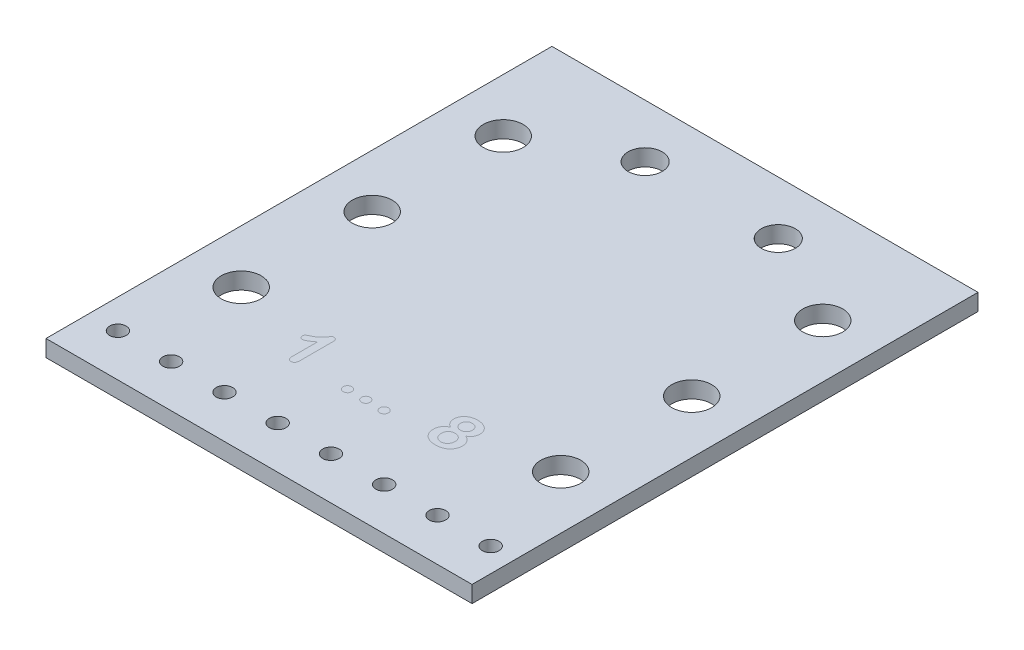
ISO-10303-21;
HEADER;
FILE_DESCRIPTION(('STEP AP214'),'2;1');
FILE_NAME('part.step','',(''),(''),'','','');
FILE_SCHEMA(('AUTOMOTIVE_DESIGN { 1 0 10303 214 1 1 1 1 }'));
ENDSEC;
DATA;
#1=APPLICATION_CONTEXT('core data for automotive mechanical design processes');
#2=APPLICATION_PROTOCOL_DEFINITION('international standard','automotive_design',2000,#1);
#3=PRODUCT_CONTEXT('',#1,'mechanical');
#4=PRODUCT('Part','Part','',(#3));
#5=PRODUCT_RELATED_PRODUCT_CATEGORY('part','',(#4));
#6=PRODUCT_DEFINITION_FORMATION('','',#4);
#7=PRODUCT_DEFINITION_CONTEXT('part definition',#1,'design');
#8=PRODUCT_DEFINITION('design','',#6,#7);
#9=PRODUCT_DEFINITION_SHAPE('','',#8);
#10=(LENGTH_UNIT() NAMED_UNIT(*) SI_UNIT(.MILLI.,.METRE.));
#11=(NAMED_UNIT(*) PLANE_ANGLE_UNIT() SI_UNIT($,.RADIAN.));
#12=(NAMED_UNIT(*) SI_UNIT($,.STERADIAN.) SOLID_ANGLE_UNIT());
#13=UNCERTAINTY_MEASURE_WITH_UNIT(LENGTH_MEASURE(1.E-05),#10,'distance_accuracy_value','');
#14=(GEOMETRIC_REPRESENTATION_CONTEXT(3) GLOBAL_UNCERTAINTY_ASSIGNED_CONTEXT((#13)) GLOBAL_UNIT_ASSIGNED_CONTEXT((#10,
#11,#12)) REPRESENTATION_CONTEXT('',''));
#15=CARTESIAN_POINT('',(0.,0.,0.));
#16=DIRECTION('',(0.,0.,1.));
#17=DIRECTION('',(1.,0.,0.));
#18=AXIS2_PLACEMENT_3D('',#15,#16,#17);
#19=CARTESIAN_POINT('',(0.,0.,0.));
#20=DIRECTION('',(0.,-1.,0.));
#21=DIRECTION('',(0.,0.,-1.));
#22=AXIS2_PLACEMENT_3D('',#19,#20,#21);
#23=PLANE('',#22);
#24=CARTESIAN_POINT('',(27.3571931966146,0.,-10.2920973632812));
#25=CARTESIAN_POINT('',(27.3883001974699,0.,-10.2931789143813));
#26=CARTESIAN_POINT('',(27.4490710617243,0.,-10.2952918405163));
#27=CARTESIAN_POINT('',(27.5378890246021,0.,-10.31184777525));
#28=CARTESIAN_POINT('',(27.6217641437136,0.,-10.3389123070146));
#29=CARTESIAN_POINT('',(27.7002416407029,0.,-10.3779409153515));
#30=CARTESIAN_POINT('',(27.7720015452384,0.,-10.4268713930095));
#31=CARTESIAN_POINT('',(27.8374538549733,0.,-10.4840350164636));
#32=CARTESIAN_POINT('',(27.8928675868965,0.,-10.5517622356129));
#33=CARTESIAN_POINT('',(27.9405654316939,0.,-10.6273031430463));
#34=CARTESIAN_POINT('',(27.9779591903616,0.,-10.7108937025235));
#35=CARTESIAN_POINT('',(28.0055050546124,0.,-10.8005841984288));
#36=CARTESIAN_POINT('',(28.0217389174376,0.,-10.8964046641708));
#37=CARTESIAN_POINT('',(28.0238649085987,0.,-10.9622055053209));
#38=CARTESIAN_POINT('',(28.0249560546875,0.,-10.9959772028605));
#39=B_SPLINE_CURVE_WITH_KNOTS('',3,(#24,#25,#26,#27,#28,#29,#30,#31,#32,#33,#34,#35,#36,#37,
#38),.UNSPECIFIED.,.F.,.F.,(4,1,1,1,1,1,1,1,1,1,1,1,4),(0.,0.0857409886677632,0.167504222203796,
0.248232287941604,0.328082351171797,0.408299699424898,0.487217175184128,0.566852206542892,
0.64873519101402,0.732938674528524,0.818590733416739,0.906893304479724,1.),.UNSPECIFIED.);
#40=CARTESIAN_POINT('',(27.3571931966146,0.,-10.2920973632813));
#41=VERTEX_POINT('',#40);
#42=CARTESIAN_POINT('',(28.0249560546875,0.,-10.9959772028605));
#43=VERTEX_POINT('',#42);
#44=EDGE_CURVE('E482',#41,#43,#39,.T.);
#45=ORIENTED_EDGE('',*,*,#44,.F.);
#46=CARTESIAN_POINT('',(26.6894303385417,0.,-10.9911616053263));
#47=CARTESIAN_POINT('',(26.6904190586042,0.,-10.9573701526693));
#48=CARTESIAN_POINT('',(26.6923468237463,0.,-10.8914849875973));
#49=CARTESIAN_POINT('',(26.7100228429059,0.,-10.7958948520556));
#50=CARTESIAN_POINT('',(26.7368273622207,0.,-10.7060651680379));
#51=CARTESIAN_POINT('',(26.7755535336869,0.,-10.623261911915));
#52=CARTESIAN_POINT('',(26.823872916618,0.,-10.5484092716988));
#53=CARTESIAN_POINT('',(26.8801669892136,0.,-10.4821104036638));
#54=CARTESIAN_POINT('',(26.9448426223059,0.,-10.4249936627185));
#55=CARTESIAN_POINT('',(27.0167636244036,0.,-10.3768491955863));
#56=CARTESIAN_POINT('',(27.0956432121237,0.,-10.3394309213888));
#57=CARTESIAN_POINT('',(27.1788439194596,0.,-10.3117413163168));
#58=CARTESIAN_POINT('',(27.2666634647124,0.,-10.2953698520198));
#59=CARTESIAN_POINT('',(27.3266260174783,0.,-10.2932023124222));
#60=CARTESIAN_POINT('',(27.3571931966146,0.,-10.2920973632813));
#61=B_SPLINE_CURVE_WITH_KNOTS('',3,(#46,#47,#48,#49,#50,#51,#52,#53,#54,#55,#56,#57,#58,#59,
#60),.UNSPECIFIED.,.F.,.F.,(4,1,1,1,1,1,1,1,1,1,1,1,4),(0.,0.0935336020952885,0.18236791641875,
0.268412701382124,0.352637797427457,0.43466884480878,0.514579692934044,0.592812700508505,
0.672984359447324,0.753542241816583,0.833936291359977,0.915345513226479,1.),.UNSPECIFIED.);
#62=CARTESIAN_POINT('',(26.6894303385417,0.,-10.9911616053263));
#63=VERTEX_POINT('',#62);
#64=EDGE_CURVE('E457',#63,#41,#61,.T.);
#65=ORIENTED_EDGE('',*,*,#64,.F.);
#66=CARTESIAN_POINT('',(27.341141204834,0.,-11.678989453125));
#67=CARTESIAN_POINT('',(27.3183858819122,0.,-11.6782383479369));
#68=CARTESIAN_POINT('',(27.2738055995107,0.,-11.6767668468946));
#69=CARTESIAN_POINT('',(27.2083339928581,0.,-11.6691815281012));
#70=CARTESIAN_POINT('',(27.1462567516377,0.,-11.6540539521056));
#71=CARTESIAN_POINT('',(27.0862492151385,0.,-11.6352387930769));
#72=CARTESIAN_POINT('',(27.0293170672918,0.,-11.609340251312));
#73=CARTESIAN_POINT('',(26.9751475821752,0.,-11.5776854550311));
#74=CARTESIAN_POINT('',(26.9236227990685,0.,-11.5408119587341));
#75=CARTESIAN_POINT('',(26.875696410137,0.,-11.4981463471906));
#76=CARTESIAN_POINT('',(26.8312297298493,0.,-11.4512934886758));
#77=CARTESIAN_POINT('',(26.7933654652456,0.,-11.3984208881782));
#78=CARTESIAN_POINT('',(26.7613380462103,0.,-11.341255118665));
#79=CARTESIAN_POINT('',(26.7345727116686,0.,-11.2800727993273));
#80=CARTESIAN_POINT('',(26.7144725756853,0.,-11.2140432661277));
#81=CARTESIAN_POINT('',(26.7003672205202,0.,-11.1436029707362));
#82=CARTESIAN_POINT('',(26.6913300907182,0.,-11.0687091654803));
#83=CARTESIAN_POINT('',(26.6900732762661,0.,-11.0174062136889));
#84=CARTESIAN_POINT('',(26.6894303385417,0.,-10.9911616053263));
#85=B_SPLINE_CURVE_WITH_KNOTS('',3,(#66,#67,#68,#69,#70,#71,#72,#73,#74,#75,#76,#77,#78,#79,#80,
#81,#82,#83,#84),.UNSPECIFIED.,.F.,.F.,(4,1,1,1,1,1,1,1,1,1,1,1,1,1,1,1,4),(0.,
0.0640095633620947,0.125402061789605,0.184884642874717,0.243403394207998,0.301984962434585,
0.360300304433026,0.419587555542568,0.479807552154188,0.540481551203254,0.600818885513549,
0.662119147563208,0.724444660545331,0.78821066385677,0.855776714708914,0.926220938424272,1.),.UNSPECIFIED.);
#86=CARTESIAN_POINT('',(27.341141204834,0.,-11.678989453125));
#87=VERTEX_POINT('',#86);
#88=EDGE_CURVE('E466',#87,#63,#85,.T.);
#89=ORIENTED_EDGE('',*,*,#88,.F.);
#90=CARTESIAN_POINT('',(28.0249560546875,0.,-10.9959772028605));
#91=CARTESIAN_POINT('',(28.0238311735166,0.,-11.0294744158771));
#92=CARTESIAN_POINT('',(28.0216309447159,0.,-11.0949938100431));
#93=CARTESIAN_POINT('',(28.00586126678,0.,-11.1898750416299));
#94=CARTESIAN_POINT('',(27.977872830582,0.,-11.2778703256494));
#95=CARTESIAN_POINT('',(27.9406575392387,0.,-11.3593523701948));
#96=CARTESIAN_POINT('',(27.8919458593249,0.,-11.4322599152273));
#97=CARTESIAN_POINT('',(27.8356549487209,0.,-11.4978201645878));
#98=CARTESIAN_POINT('',(27.7686976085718,0.,-11.5526196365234));
#99=CARTESIAN_POINT('',(27.6940103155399,0.,-11.5981570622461));
#100=CARTESIAN_POINT('',(27.6128220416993,0.,-11.6344630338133));
#101=CARTESIAN_POINT('',(27.5263634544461,0.,-11.659661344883));
#102=CARTESIAN_POINT('',(27.435459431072,0.,-11.6768896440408));
#103=CARTESIAN_POINT('',(27.3730609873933,0.,-11.6782788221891));
#104=CARTESIAN_POINT('',(27.341141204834,0.,-11.678989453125));
#105=B_SPLINE_CURVE_WITH_KNOTS('',3,(#90,#91,#92,#93,#94,#95,#96,#97,#98,#99,#100,#101,#102,
#103,#104),.UNSPECIFIED.,.F.,.F.,(4,1,1,1,1,1,1,1,1,1,1,1,4),(0.,0.0923554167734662,
0.180644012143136,0.264169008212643,0.346347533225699,0.426755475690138,0.505172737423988,
0.583756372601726,0.664221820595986,0.745788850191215,0.828175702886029,0.912103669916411,1.),.UNSPECIFIED.);
#106=EDGE_CURVE('E474',#43,#87,#105,.T.);
#107=ORIENTED_EDGE('',*,*,#106,.F.);
#108=EDGE_LOOP('',(#45,#65,#89,#107));
#109=FACE_BOUND('',#108,.T.);
#110=CARTESIAN_POINT('',(26.6372613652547,0.,-11.9558863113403));
#111=CARTESIAN_POINT('',(26.5945863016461,0.,-11.9788798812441));
#112=CARTESIAN_POINT('',(26.5114921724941,0.,-12.0236514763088));
#113=CARTESIAN_POINT('',(26.4013740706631,0.,-12.1070000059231));
#114=CARTESIAN_POINT('',(26.3070487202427,0.,-12.1991874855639));
#115=CARTESIAN_POINT('',(26.2311429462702,0.,-12.3025101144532));
#116=CARTESIAN_POINT('',(26.1705756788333,0.,-12.4148933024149));
#117=CARTESIAN_POINT('',(26.129297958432,0.,-12.5381631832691));
#118=CARTESIAN_POINT('',(26.1025741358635,0.,-12.6703831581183));
#119=CARTESIAN_POINT('',(26.1000230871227,0.,-12.7620959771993));
#120=CARTESIAN_POINT('',(26.0987170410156,0.,-12.8090496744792));
#121=B_SPLINE_CURVE_WITH_KNOTS('',3,(#110,#111,#112,#113,#114,#115,#116,#117,#118,#119,#120),
.UNSPECIFIED.,.F.,.F.,(4,1,1,1,1,1,1,1,4),(0.,0.135876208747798,0.264569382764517,
0.386151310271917,0.504785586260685,0.623020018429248,0.742930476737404,0.868389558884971,1.),.UNSPECIFIED.);
#122=CARTESIAN_POINT('',(26.6372613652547,0.,-11.9558863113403));
#123=VERTEX_POINT('',#122);
#124=CARTESIAN_POINT('',(26.0987170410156,0.,-12.8090496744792));
#125=VERTEX_POINT('',#124);
#126=EDGE_CURVE('E449',#123,#125,#121,.T.);
#127=ORIENTED_EDGE('',*,*,#126,.F.);
#128=CARTESIAN_POINT('',(25.9703011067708,0.,-10.9686888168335));
#129=CARTESIAN_POINT('',(25.9706519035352,0.,-10.9981416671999));
#130=CARTESIAN_POINT('',(25.971338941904,0.,-11.0558253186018));
#131=CARTESIAN_POINT('',(25.9800448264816,0.,-11.1407316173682));
#132=CARTESIAN_POINT('',(25.9920708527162,0.,-11.2221757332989));
#133=CARTESIAN_POINT('',(26.0113165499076,0.,-11.299993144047));
#134=CARTESIAN_POINT('',(26.0336944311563,0.,-11.3744617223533));
#135=CARTESIAN_POINT('',(26.0635728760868,0.,-11.4448489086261));
#136=CARTESIAN_POINT('',(26.0966061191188,0.,-11.5124832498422));
#137=CARTESIAN_POINT('',(26.1365989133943,0.,-11.5759050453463));
#138=CARTESIAN_POINT('',(26.1804372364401,0.,-11.6365815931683));
#139=CARTESIAN_POINT('',(26.2307844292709,0.,-11.692656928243));
#140=CARTESIAN_POINT('',(26.2852349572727,0.,-11.7457852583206));
#141=CARTESIAN_POINT('',(26.3452574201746,0.,-11.7953529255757));
#142=CARTESIAN_POINT('',(26.4110354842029,0.,-11.8403338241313));
#143=CARTESIAN_POINT('',(26.4810365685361,0.,-11.8835335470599));
#144=CARTESIAN_POINT('',(26.5569061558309,0.,-11.9220252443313));
#145=CARTESIAN_POINT('',(26.6100964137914,0.,-11.9444392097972));
#146=CARTESIAN_POINT('',(26.6372613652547,0.,-11.9558863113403));
#147=B_SPLINE_CURVE_WITH_KNOTS('',3,(#128,#129,#130,#131,#132,#133,#134,#135,#136,#137,#138,
#139,#140,#141,#142,#143,#144,#145,#146),.UNSPECIFIED.,.F.,.F.,(4,1,1,1,1,1,1,1,1,1,1,1,1,1,1,1,
4),(0.,0.069183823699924,0.135497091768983,0.200409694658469,0.262473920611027,
0.323720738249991,0.382916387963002,0.441961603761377,0.500407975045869,0.558881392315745,
0.617671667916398,0.677250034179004,0.737543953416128,0.80033002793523,0.864378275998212,
0.930736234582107,1.),.UNSPECIFIED.);
#148=CARTESIAN_POINT('',(25.9703011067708,0.,-10.9686888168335));
#149=VERTEX_POINT('',#148);
#150=EDGE_CURVE('E392',#149,#123,#147,.T.);
#151=ORIENTED_EDGE('',*,*,#150,.F.);
#152=CARTESIAN_POINT('',(27.3628113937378,0.,-9.77843362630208));
#153=CARTESIAN_POINT('',(27.3266826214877,0.,-9.7788880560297));
#154=CARTESIAN_POINT('',(27.2554215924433,0.,-9.77978438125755));
#155=CARTESIAN_POINT('',(27.1506789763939,0.,-9.78708879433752));
#156=CARTESIAN_POINT('',(27.0496890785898,0.,-9.79912715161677));
#157=CARTESIAN_POINT('',(26.9529305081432,0.,-9.81580657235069));
#158=CARTESIAN_POINT('',(26.8598124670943,0.,-9.83739549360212));
#159=CARTESIAN_POINT('',(26.7712555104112,0.,-9.86478174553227));
#160=CARTESIAN_POINT('',(26.6862439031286,0.,-9.89622697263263));
#161=CARTESIAN_POINT('',(26.6052822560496,0.,-9.93193347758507));
#162=CARTESIAN_POINT('',(26.5292943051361,0.,-9.97321762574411));
#163=CARTESIAN_POINT('',(26.4573484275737,0.,-10.0171487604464));
#164=CARTESIAN_POINT('',(26.3908510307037,0.,-10.0655492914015));
#165=CARTESIAN_POINT('',(26.3285291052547,0.,-10.1168878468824));
#166=CARTESIAN_POINT('',(26.2716865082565,0.,-10.1724714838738));
#167=CARTESIAN_POINT('',(26.2190337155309,0.,-10.2311977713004));
#168=CARTESIAN_POINT('',(26.1718208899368,0.,-10.29394683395));
#169=CARTESIAN_POINT('',(26.1150901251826,0.,-10.3815819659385));
#170=CARTESIAN_POINT('',(26.0566272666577,0.,-10.4987294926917));
#171=CARTESIAN_POINT('',(26.0073020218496,0.,-10.6482709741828));
#172=CARTESIAN_POINT('',(25.9750465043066,0.,-10.8057247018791));
#173=CARTESIAN_POINT('',(25.9719028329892,0.,-10.9136831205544));
#174=CARTESIAN_POINT('',(25.9703011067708,0.,-10.9686888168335));
#175=B_SPLINE_CURVE_WITH_KNOTS('',3,(#152,#153,#154,#155,#156,#157,#158,#159,#160,#161,#162,
#163,#164,#165,#166,#167,#168,#169,#170,#171,#172,#173,#174),.UNSPECIFIED.,.F.,.F.,(4,1,1,1,1,1,
1,1,1,1,1,1,1,1,1,1,1,1,1,1,4),(0.,0.0525072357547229,0.103566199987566,0.15252072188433,
0.200274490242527,0.246207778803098,0.291349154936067,0.334903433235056,0.377898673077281,
0.419825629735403,0.460507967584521,0.500331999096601,0.539265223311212,0.577762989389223,
0.615770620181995,0.653800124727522,0.691765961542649,0.767411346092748,0.843280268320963,
0.920150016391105,1.),.UNSPECIFIED.);
#176=CARTESIAN_POINT('',(27.3628113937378,0.,-9.77843362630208));
#177=VERTEX_POINT('',#176);
#178=EDGE_CURVE('E401',#177,#149,#175,.T.);
#179=ORIENTED_EDGE('',*,*,#178,.F.);
#180=CARTESIAN_POINT('',(28.7440852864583,0.,-10.9743070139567));
#181=CARTESIAN_POINT('',(28.7421160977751,0.,-10.9193095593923));
#182=CARTESIAN_POINT('',(28.7382423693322,0.,-10.8111202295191));
#183=CARTESIAN_POINT('',(28.7064582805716,0.,-10.6529937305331));
#184=CARTESIAN_POINT('',(28.6562299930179,0.,-10.5022169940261));
#185=CARTESIAN_POINT('',(28.5958526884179,0.,-10.3847401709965));
#186=CARTESIAN_POINT('',(28.539768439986,0.,-10.295325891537));
#187=CARTESIAN_POINT('',(28.490906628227,0.,-10.233112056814));
#188=CARTESIAN_POINT('',(28.439081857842,0.,-10.1729116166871));
#189=CARTESIAN_POINT('',(28.3807229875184,0.,-10.1180590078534));
#190=CARTESIAN_POINT('',(28.319041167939,0.,-10.0654521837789));
#191=CARTESIAN_POINT('',(28.2520539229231,0.,-10.016962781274));
#192=CARTESIAN_POINT('',(28.1796171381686,0.,-9.97341892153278));
#193=CARTESIAN_POINT('',(28.1036717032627,0.,-9.93212728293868));
#194=CARTESIAN_POINT('',(28.0231553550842,0.,-9.8960005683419));
#195=CARTESIAN_POINT('',(27.9387404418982,0.,-9.86512089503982));
#196=CARTESIAN_POINT('',(27.8514012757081,0.,-9.83732338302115));
#197=CARTESIAN_POINT('',(27.7603542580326,0.,-9.81602041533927));
#198=CARTESIAN_POINT('',(27.6660661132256,0.,-9.79900901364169));
#199=CARTESIAN_POINT('',(27.5682506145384,0.,-9.78719983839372));
#200=CARTESIAN_POINT('',(27.466730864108,0.,-9.77974178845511));
#201=CARTESIAN_POINT('',(27.3978715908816,0.,-9.77887497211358));
#202=CARTESIAN_POINT('',(27.3628113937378,0.,-9.77843362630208));
#203=B_SPLINE_CURVE_WITH_KNOTS('',3,(#180,#181,#182,#183,#184,#185,#186,#187,#188,#189,#190,
#191,#192,#193,#194,#195,#196,#197,#198,#199,#200,#201,#202),.UNSPECIFIED.,.F.,.F.,(4,1,1,1,1,1,
1,1,1,1,1,1,1,1,1,1,1,1,1,1,4),(0.,0.080225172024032,0.157816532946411,0.234514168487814,
0.311541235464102,0.350002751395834,0.388436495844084,0.426903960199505,0.465852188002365,
0.505207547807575,0.545206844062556,0.586400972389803,0.628512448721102,0.671340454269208,
0.715086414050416,0.759680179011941,0.805055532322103,0.851481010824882,0.899487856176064,
0.948823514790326,1.),.UNSPECIFIED.);
#204=CARTESIAN_POINT('',(28.7440852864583,0.,-10.9743070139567));
#205=VERTEX_POINT('',#204);
#206=EDGE_CURVE('E409',#205,#177,#203,.T.);
#207=ORIENTED_EDGE('',*,*,#206,.F.);
#208=CARTESIAN_POINT('',(28.0771250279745,0.,-11.9558863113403));
#209=CARTESIAN_POINT('',(28.1130467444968,0.,-11.9408144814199));
#210=CARTESIAN_POINT('',(28.1832358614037,0.,-11.9113649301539));
#211=CARTESIAN_POINT('',(28.2808447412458,0.,-11.8559892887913));
#212=CARTESIAN_POINT('',(28.3693857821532,0.,-11.7946262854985));
#213=CARTESIAN_POINT('',(28.4479594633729,0.,-11.72565544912));
#214=CARTESIAN_POINT('',(28.5169129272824,0.,-11.6508018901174));
#215=CARTESIAN_POINT('',(28.5779595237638,0.,-11.5707910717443));
#216=CARTESIAN_POINT('',(28.6294876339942,0.,-11.484690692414));
#217=CARTESIAN_POINT('',(28.6712160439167,0.,-11.3924532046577));
#218=CARTESIAN_POINT('',(28.7042879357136,0.,-11.2951931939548));
#219=CARTESIAN_POINT('',(28.7274486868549,0.,-11.1927075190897));
#220=CARTESIAN_POINT('',(28.7412717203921,0.,-11.0851772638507));
#221=CARTESIAN_POINT('',(28.7431337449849,0.,-11.0118030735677));
#222=CARTESIAN_POINT('',(28.7440852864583,0.,-10.9743070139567));
#223=B_SPLINE_CURVE_WITH_KNOTS('',3,(#208,#209,#210,#211,#212,#213,#214,#215,#216,#217,#218,
#219,#220,#221,#222),.UNSPECIFIED.,.F.,.F.,(4,1,1,1,1,1,1,1,1,1,1,1,4),(0.,0.0920514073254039,
0.17986353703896,0.264812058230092,0.346407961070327,0.426546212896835,0.505123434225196,
0.584003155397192,0.663275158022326,0.744102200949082,0.826518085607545,0.911346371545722,1.),.UNSPECIFIED.);
#224=CARTESIAN_POINT('',(28.0771250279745,0.,-11.9558863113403));
#225=VERTEX_POINT('',#224);
#226=EDGE_CURVE('E417',#225,#205,#223,.T.);
#227=ORIENTED_EDGE('',*,*,#226,.F.);
#228=CARTESIAN_POINT('',(28.6052355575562,0.,-12.7809586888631));
#229=CARTESIAN_POINT('',(28.6038244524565,0.,-12.7372266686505));
#230=CARTESIAN_POINT('',(28.6010559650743,0.,-12.6514275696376));
#231=CARTESIAN_POINT('',(28.5753389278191,0.,-12.5264995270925));
#232=CARTESIAN_POINT('',(28.5334113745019,0.,-12.408843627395));
#233=CARTESIAN_POINT('',(28.4744323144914,0.,-12.2989662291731));
#234=CARTESIAN_POINT('',(28.3987384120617,0.,-12.1980945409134));
#235=CARTESIAN_POINT('',(28.3081683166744,0.,-12.1051707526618));
#236=CARTESIAN_POINT('',(28.1993167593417,0.,-12.0241211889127));
#237=CARTESIAN_POINT('',(28.1186118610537,0.,-11.9790535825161));
#238=CARTESIAN_POINT('',(28.0771250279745,0.,-11.9558863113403));
#239=B_SPLINE_CURVE_WITH_KNOTS('',3,(#228,#229,#230,#231,#232,#233,#234,#235,#236,#237,#238),
.UNSPECIFIED.,.F.,.F.,(4,1,1,1,1,1,1,1,4),(0.,0.126622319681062,0.248423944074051,
0.367863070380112,0.487543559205,0.60834651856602,0.732259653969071,0.862366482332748,1.),.UNSPECIFIED.);
#240=CARTESIAN_POINT('',(28.6052355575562,0.,-12.7809586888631));
#241=VERTEX_POINT('',#240);
#242=EDGE_CURVE('E425',#241,#225,#239,.T.);
#243=ORIENTED_EDGE('',*,*,#242,.F.);
#244=CARTESIAN_POINT('',(27.3307074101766,0.,-13.8363771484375));
#245=CARTESIAN_POINT('',(27.3821010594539,0.,-13.8351748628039));
#246=CARTESIAN_POINT('',(27.4819117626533,0.,-13.8328399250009));
#247=CARTESIAN_POINT('',(27.6268613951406,0.,-13.8183873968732));
#248=CARTESIAN_POINT('',(27.7617049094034,0.,-13.7903998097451));
#249=CARTESIAN_POINT('',(27.8873367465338,0.,-13.753988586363));
#250=CARTESIAN_POINT('',(28.0030328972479,0.,-13.7073351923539));
#251=CARTESIAN_POINT('',(28.1089462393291,0.,-13.6525519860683));
#252=CARTESIAN_POINT('',(28.205117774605,0.,-13.5901082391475));
#253=CARTESIAN_POINT('',(28.2903137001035,0.,-13.5188352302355));
#254=CARTESIAN_POINT('',(28.3659908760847,0.,-13.4422146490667));
#255=CARTESIAN_POINT('',(28.4304621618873,0.,-13.3593958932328));
#256=CARTESIAN_POINT('',(28.4857973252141,0.,-13.272774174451));
#257=CARTESIAN_POINT('',(28.528985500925,0.,-13.1804620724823));
#258=CARTESIAN_POINT('',(28.5624010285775,0.,-13.0848324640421));
#259=CARTESIAN_POINT('',(28.5878918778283,0.,-12.9864483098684));
#260=CARTESIAN_POINT('',(28.6024747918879,0.,-12.8846663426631));
#261=CARTESIAN_POINT('',(28.6043085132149,0.,-12.8157829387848));
#262=CARTESIAN_POINT('',(28.6052355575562,0.,-12.7809586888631));
#263=B_SPLINE_CURVE_WITH_KNOTS('',3,(#244,#245,#246,#247,#248,#249,#250,#251,#252,#253,#254,
#255,#256,#257,#258,#259,#260,#261,#262),.UNSPECIFIED.,.F.,.F.,(4,1,1,1,1,1,1,1,1,1,1,1,1,1,1,1,
4),(0.,0.0829448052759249,0.161085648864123,0.234661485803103,0.304876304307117,
0.37189686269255,0.43561723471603,0.497044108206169,0.556520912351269,0.614525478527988,
0.670489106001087,0.725586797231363,0.780044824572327,0.834525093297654,0.888868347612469,
0.94381699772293,1.),.UNSPECIFIED.);
#264=CARTESIAN_POINT('',(27.3307074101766,0.,-13.8363771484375));
#265=VERTEX_POINT('',#264);
#266=EDGE_CURVE('E433',#265,#241,#263,.T.);
#267=ORIENTED_EDGE('',*,*,#266,.F.);
#268=CARTESIAN_POINT('',(26.0987170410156,0.,-12.8090496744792));
#269=CARTESIAN_POINT('',(26.1003321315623,0.,-12.8533335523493));
#270=CARTESIAN_POINT('',(26.1035447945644,0.,-12.9414209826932));
#271=CARTESIAN_POINT('',(26.1320443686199,0.,-13.0712217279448));
#272=CARTESIAN_POINT('',(26.1784174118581,0.,-13.1965265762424));
#273=CARTESIAN_POINT('',(26.2418233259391,0.,-13.3174267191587));
#274=CARTESIAN_POINT('',(26.3232925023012,0.,-13.430236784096));
#275=CARTESIAN_POINT('',(26.4229479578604,0.,-13.5320203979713));
#276=CARTESIAN_POINT('',(26.5396167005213,0.,-13.6212417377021));
#277=CARTESIAN_POINT('',(26.6720824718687,0.,-13.6982885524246));
#278=CARTESIAN_POINT('',(26.819409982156,0.,-13.7598619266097));
#279=CARTESIAN_POINT('',(26.9791174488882,0.,-13.8048584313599));
#280=CARTESIAN_POINT('',(27.1510905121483,0.,-13.8316904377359));
#281=CARTESIAN_POINT('',(27.2696117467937,0.,-13.8347829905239));
#282=CARTESIAN_POINT('',(27.3307074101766,0.,-13.8363771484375));
#283=B_SPLINE_CURVE_WITH_KNOTS('',3,(#268,#269,#270,#271,#272,#273,#274,#275,#276,#277,#278,
#279,#280,#281,#282),.UNSPECIFIED.,.F.,.F.,(4,1,1,1,1,1,1,1,1,1,1,1,4),(0.,0.0740838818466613,
0.147364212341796,0.221350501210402,0.297300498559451,0.375263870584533,0.453515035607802,
0.534968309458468,0.620489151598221,0.709434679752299,0.801617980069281,0.897737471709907,1.),.UNSPECIFIED.);
#284=EDGE_CURVE('E441',#125,#265,#283,.T.);
#285=ORIENTED_EDGE('',*,*,#284,.F.);
#286=EDGE_LOOP('',(#127,#151,#179,#207,#227,#243,#267,#285));
#287=FACE_BOUND('',#286,.T.);
#288=CARTESIAN_POINT('',(27.9190129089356,0.,-12.7480521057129));
#289=CARTESIAN_POINT('',(27.9179240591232,0.,-12.7745689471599));
#290=CARTESIAN_POINT('',(27.9157775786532,0.,-12.8268423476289));
#291=CARTESIAN_POINT('',(27.9037413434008,0.,-12.9033540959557));
#292=CARTESIAN_POINT('',(27.8791812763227,0.,-12.9748217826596));
#293=CARTESIAN_POINT('',(27.8485156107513,0.,-13.0423321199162));
#294=CARTESIAN_POINT('',(27.8088017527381,0.,-13.104196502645));
#295=CARTESIAN_POINT('',(27.7624493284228,0.,-13.1604652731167));
#296=CARTESIAN_POINT('',(27.7066675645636,0.,-13.2078638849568));
#297=CARTESIAN_POINT('',(27.6451101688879,0.,-13.2488764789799));
#298=CARTESIAN_POINT('',(27.5773671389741,0.,-13.2817918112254));
#299=CARTESIAN_POINT('',(27.5046959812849,0.,-13.3063600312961));
#300=CARTESIAN_POINT('',(27.4267150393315,0.,-13.3198364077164));
#301=CARTESIAN_POINT('',(27.3732938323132,0.,-13.3217395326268));
#302=CARTESIAN_POINT('',(27.3459568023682,0.,-13.3227134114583));
#303=B_SPLINE_CURVE_WITH_KNOTS('',3,(#288,#289,#290,#291,#292,#293,#294,#295,#296,#297,#298,
#299,#300,#301,#302),.UNSPECIFIED.,.F.,.F.,(4,1,1,1,1,1,1,1,1,1,1,1,4),(0.,0.0875706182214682,
0.172630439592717,0.254438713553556,0.336208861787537,0.416793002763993,0.49637938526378,
0.575867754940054,0.657413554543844,0.739942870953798,0.823705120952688,0.909785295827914,1.),.UNSPECIFIED.);
#304=CARTESIAN_POINT('',(27.9190129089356,0.,-12.7480521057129));
#305=VERTEX_POINT('',#304);
#306=CARTESIAN_POINT('',(27.3459568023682,0.,-13.3227134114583));
#307=VERTEX_POINT('',#306);
#308=EDGE_CURVE('E11',#305,#307,#303,.T.);
#309=ORIENTED_EDGE('',*,*,#308,.F.);
#310=CARTESIAN_POINT('',(27.3515749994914,0.,-12.1926531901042));
#311=CARTESIAN_POINT('',(27.372473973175,0.,-12.1930138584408));
#312=CARTESIAN_POINT('',(27.4133656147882,0.,-12.1937195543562));
#313=CARTESIAN_POINT('',(27.472952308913,0.,-12.2022190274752));
#314=CARTESIAN_POINT('',(27.5298061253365,0.,-12.214780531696));
#315=CARTESIAN_POINT('',(27.6003265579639,0.,-12.2393023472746));
#316=CARTESIAN_POINT('',(27.6812436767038,0.,-12.2803282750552));
#317=CARTESIAN_POINT('',(27.7652570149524,0.,-12.3465153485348));
#318=CARTESIAN_POINT('',(27.8324052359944,0.,-12.4285023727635));
#319=CARTESIAN_POINT('',(27.881978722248,0.,-12.5243433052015));
#320=CARTESIAN_POINT('',(27.9133848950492,0.,-12.6324312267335));
#321=CARTESIAN_POINT('',(27.9171010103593,0.,-12.7087744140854));
#322=CARTESIAN_POINT('',(27.9190129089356,0.,-12.7480521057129));
#323=B_SPLINE_CURVE_WITH_KNOTS('',3,(#310,#311,#312,#313,#314,#315,#316,#317,#318,#319,#320,
#321,#322),.UNSPECIFIED.,.F.,.F.,(4,1,1,1,1,1,1,1,1,1,4),(0.,0.0703756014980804,
0.137699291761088,0.202437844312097,0.266304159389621,0.388883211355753,0.506314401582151,
0.62417742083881,0.743138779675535,0.867847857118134,1.),.UNSPECIFIED.);
#324=CARTESIAN_POINT('',(27.3515749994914,0.,-12.1926531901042));
#325=VERTEX_POINT('',#324);
#326=EDGE_CURVE('E40',#325,#305,#323,.T.);
#327=ORIENTED_EDGE('',*,*,#326,.F.);
#328=CARTESIAN_POINT('',(26.778518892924,0.,-12.7424339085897));
#329=CARTESIAN_POINT('',(26.7800561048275,0.,-12.7044634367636));
#330=CARTESIAN_POINT('',(26.7830437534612,0.,-12.6306659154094));
#331=CARTESIAN_POINT('',(26.8155591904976,0.,-12.5255073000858));
#332=CARTESIAN_POINT('',(26.865577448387,0.,-12.4297440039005));
#333=CARTESIAN_POINT('',(26.9359561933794,0.,-12.3463981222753));
#334=CARTESIAN_POINT('',(27.0219425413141,0.,-12.2776211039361));
#335=CARTESIAN_POINT('',(27.1218802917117,0.,-12.2282865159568));
#336=CARTESIAN_POINT('',(27.2331143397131,0.,-12.1974104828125));
#337=CARTESIAN_POINT('',(27.3112360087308,0.,-12.1942731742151));
#338=CARTESIAN_POINT('',(27.3515749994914,0.,-12.1926531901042));
#339=B_SPLINE_CURVE_WITH_KNOTS('',3,(#328,#329,#330,#331,#332,#333,#334,#335,#336,#337,#338),
.UNSPECIFIED.,.F.,.F.,(4,1,1,1,1,1,1,1,4),(0.,0.127772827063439,0.248332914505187,
0.367891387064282,0.490320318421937,0.613707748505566,0.73686701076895,0.864128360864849,1.),.UNSPECIFIED.);
#340=CARTESIAN_POINT('',(26.778518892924,0.,-12.7424339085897));
#341=VERTEX_POINT('',#340);
#342=EDGE_CURVE('E501',#341,#325,#339,.T.);
#343=ORIENTED_EDGE('',*,*,#342,.F.);
#344=CARTESIAN_POINT('',(27.3459568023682,0.,-13.3227134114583));
#345=CARTESIAN_POINT('',(27.3250570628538,0.,-13.3223653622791));
#346=CARTESIAN_POINT('',(27.2844292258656,0.,-13.3216887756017));
#347=CARTESIAN_POINT('',(27.2251126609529,0.,-13.3131003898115));
#348=CARTESIAN_POINT('',(27.1689098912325,0.,-13.3005233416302));
#349=CARTESIAN_POINT('',(27.1156573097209,0.,-13.2827957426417));
#350=CARTESIAN_POINT('',(27.0652435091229,0.,-13.260154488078));
#351=CARTESIAN_POINT('',(27.0180774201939,0.,-13.2322206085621));
#352=CARTESIAN_POINT('',(26.9740572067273,0.,-13.1986611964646));
#353=CARTESIAN_POINT('',(26.9204930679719,0.,-13.1480182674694));
#354=CARTESIAN_POINT('',(26.8624470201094,0.,-13.0754577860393));
#355=CARTESIAN_POINT('',(26.8143659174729,0.,-12.9742744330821));
#356=CARTESIAN_POINT('',(26.783138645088,0.,-12.862259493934));
#357=CARTESIAN_POINT('',(26.7800952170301,0.,-12.7833200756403));
#358=CARTESIAN_POINT('',(26.778518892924,0.,-12.7424339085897));
#359=B_SPLINE_CURVE_WITH_KNOTS('',3,(#344,#345,#346,#347,#348,#349,#350,#351,#352,#353,#354,
#355,#356,#357,#358),.UNSPECIFIED.,.F.,.F.,(4,1,1,1,1,1,1,1,1,1,1,1,4),(0.,0.0686973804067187,
0.13354357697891,0.19673833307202,0.257965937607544,0.3178375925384,0.378211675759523,
0.437882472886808,0.499519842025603,0.620476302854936,0.740919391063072,0.865810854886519,1.),.UNSPECIFIED.);
#360=EDGE_CURVE('E48',#307,#341,#359,.T.);
#361=ORIENTED_EDGE('',*,*,#360,.F.);
#362=EDGE_LOOP('',(#309,#327,#343,#361));
#363=FACE_BOUND('',#362,.T.);
#364=ADVANCED_FACE('F36',(#109,#287,#363),#23,.F.);
#365=ORIENTED_EDGE('',*,*,#326,.T.);
#366=ORIENTED_EDGE('',*,*,#308,.T.);
#367=ORIENTED_EDGE('',*,*,#360,.T.);
#368=ORIENTED_EDGE('',*,*,#342,.T.);
#369=EDGE_LOOP('',(#365,#366,#367,#368));
#370=FACE_BOUND('',#369,.T.);
#371=ADVANCED_FACE('F517',(#370),#23,.F.);
#372=ORIENTED_EDGE('',*,*,#64,.T.);
#373=ORIENTED_EDGE('',*,*,#44,.T.);
#374=ORIENTED_EDGE('',*,*,#106,.T.);
#375=ORIENTED_EDGE('',*,*,#88,.T.);
#376=EDGE_LOOP('',(#372,#373,#374,#375));
#377=FACE_BOUND('',#376,.T.);
#378=ADVANCED_FACE('F526',(#377),#23,.F.);
#379=CARTESIAN_POINT('',(22.4773876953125,0.,-10.1933776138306));
#380=CARTESIAN_POINT('',(22.4763236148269,0.,-10.1626850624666));
#381=CARTESIAN_POINT('',(22.4742817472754,0.,-10.1037890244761));
#382=CARTESIAN_POINT('',(22.4496516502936,0.,-10.0210015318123));
#383=CARTESIAN_POINT('',(22.4122627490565,0.,-9.94727963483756));
#384=CARTESIAN_POINT('',(22.3571744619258,0.,-9.88766432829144));
#385=CARTESIAN_POINT('',(22.2941511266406,0.,-9.83960339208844));
#386=CARTESIAN_POINT('',(22.2246147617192,0.,-9.80424757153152));
#387=CARTESIAN_POINT('',(22.1493420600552,0.,-9.78251164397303));
#388=CARTESIAN_POINT('',(22.097100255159,0.,-9.7798105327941));
#389=CARTESIAN_POINT('',(22.0704697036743,0.,-9.77843362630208));
#390=B_SPLINE_CURVE_WITH_KNOTS('',3,(#379,#380,#381,#382,#383,#384,#385,#386,#387,#388,#389),
.UNSPECIFIED.,.F.,.F.,(4,1,1,1,1,1,1,1,4),(0.,0.141157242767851,0.270867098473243,
0.395104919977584,0.519244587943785,0.641697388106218,0.759281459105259,0.877292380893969,1.),.UNSPECIFIED.);
#391=CARTESIAN_POINT('',(22.4773876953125,0.,-10.1933776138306));
#392=VERTEX_POINT('',#391);
#393=CARTESIAN_POINT('',(22.0704697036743,0.,-9.77843362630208));
#394=VERTEX_POINT('',#393);
#395=EDGE_CURVE('E384',#392,#394,#390,.T.);
#396=ORIENTED_EDGE('',*,*,#395,.F.);
#397=CARTESIAN_POINT('',(22.062443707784,0.,-10.6002956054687));
#398=CARTESIAN_POINT('',(22.0901808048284,0.,-10.5990801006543));
#399=CARTESIAN_POINT('',(22.1444874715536,0.,-10.5967002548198));
#400=CARTESIAN_POINT('',(22.2223270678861,0.,-10.572715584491));
#401=CARTESIAN_POINT('',(22.2944006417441,0.,-10.535829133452));
#402=CARTESIAN_POINT('',(22.356844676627,0.,-10.4828046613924));
#403=CARTESIAN_POINT('',(22.4110318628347,0.,-10.4217787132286));
#404=CARTESIAN_POINT('',(22.4488982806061,0.,-10.35097138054));
#405=CARTESIAN_POINT('',(22.4740820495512,0.,-10.2745268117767));
#406=CARTESIAN_POINT('',(22.4762676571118,0.,-10.2208730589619));
#407=CARTESIAN_POINT('',(22.4773876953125,0.,-10.1933776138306));
#408=B_SPLINE_CURVE_WITH_KNOTS('',3,(#397,#398,#399,#400,#401,#402,#403,#404,#405,#406,#407),
.UNSPECIFIED.,.F.,.F.,(4,1,1,1,1,1,1,1,4),(0.,0.128489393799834,0.251570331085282,
0.374970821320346,0.50210689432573,0.629891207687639,0.751685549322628,0.872748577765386,1.),.UNSPECIFIED.);
#409=CARTESIAN_POINT('',(22.062443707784,0.,-10.6002956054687));
#410=VERTEX_POINT('',#409);
#411=EDGE_CURVE('E359',#410,#392,#408,.T.);
#412=ORIENTED_EDGE('',*,*,#411,.F.);
#413=CARTESIAN_POINT('',(21.6555257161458,0.,-10.1933776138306));
#414=CARTESIAN_POINT('',(21.6567510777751,0.,-10.2203173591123));
#415=CARTESIAN_POINT('',(21.6591617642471,0.,-10.2733166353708));
#416=CARTESIAN_POINT('',(21.6832328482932,0.,-10.3491305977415));
#417=CARTESIAN_POINT('',(21.7193958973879,0.,-10.4198035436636));
#418=CARTESIAN_POINT('',(21.7713950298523,0.,-10.4817074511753));
#419=CARTESIAN_POINT('',(21.8327589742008,0.,-10.5345705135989));
#420=CARTESIAN_POINT('',(21.9032653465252,0.,-10.5730670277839));
#421=CARTESIAN_POINT('',(21.9806886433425,0.,-10.5966942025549));
#422=CARTESIAN_POINT('',(22.034717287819,0.,-10.5990742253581));
#423=CARTESIAN_POINT('',(22.062443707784,0.,-10.6002956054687));
#424=B_SPLINE_CURVE_WITH_KNOTS('',3,(#413,#414,#415,#416,#417,#418,#419,#420,#421,#422,#423),
.UNSPECIFIED.,.F.,.F.,(4,1,1,1,1,1,1,1,4),(0.,0.125955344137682,0.247795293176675,
0.369557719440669,0.496130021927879,0.624308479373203,0.747254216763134,0.870295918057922,1.),.UNSPECIFIED.);
#425=CARTESIAN_POINT('',(21.6555257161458,0.,-10.1933776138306));
#426=VERTEX_POINT('',#425);
#427=EDGE_CURVE('E368',#426,#410,#424,.T.);
#428=ORIENTED_EDGE('',*,*,#427,.F.);
#429=CARTESIAN_POINT('',(22.0704697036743,0.,-9.77843362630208));
#430=CARTESIAN_POINT('',(22.0430585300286,0.,-9.7798707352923));
#431=CARTESIAN_POINT('',(21.9896090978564,0.,-9.78267297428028));
#432=CARTESIAN_POINT('',(21.9120280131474,0.,-9.80335338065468));
#433=CARTESIAN_POINT('',(21.8410379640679,0.,-9.83851003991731));
#434=CARTESIAN_POINT('',(21.7762504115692,0.,-9.88569226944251));
#435=CARTESIAN_POINT('',(21.7220192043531,0.,-9.94587206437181));
#436=CARTESIAN_POINT('',(21.6823992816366,0.,-10.0185544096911));
#437=CARTESIAN_POINT('',(21.6599682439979,0.,-10.1027213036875));
#438=CARTESIAN_POINT('',(21.6570531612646,0.,-10.162207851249));
#439=CARTESIAN_POINT('',(21.6555257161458,0.,-10.1933776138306));
#440=B_SPLINE_CURVE_WITH_KNOTS('',3,(#429,#430,#431,#432,#433,#434,#435,#436,#437,#438,#439),
.UNSPECIFIED.,.F.,.F.,(4,1,1,1,1,1,1,1,4),(0.,0.124870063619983,0.243485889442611,
0.362926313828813,0.484146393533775,0.606787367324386,0.729027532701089,0.858015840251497,1.),.UNSPECIFIED.);
#441=EDGE_CURVE('E376',#394,#426,#440,.T.);
#442=ORIENTED_EDGE('',*,*,#441,.F.);
#443=EDGE_LOOP('',(#396,#412,#428,#442));
#444=FACE_BOUND('',#443,.T.);
#445=ADVANCED_FACE('F824',(#444),#23,.F.);
#446=CARTESIAN_POINT('',(20.7309309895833,0.,-10.1933776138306));
#447=CARTESIAN_POINT('',(20.7298669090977,0.,-10.1626850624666));
#448=CARTESIAN_POINT('',(20.7278250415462,0.,-10.1037890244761));
#449=CARTESIAN_POINT('',(20.7031949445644,0.,-10.0210015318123));
#450=CARTESIAN_POINT('',(20.6658060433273,0.,-9.94727963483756));
#451=CARTESIAN_POINT('',(20.6107177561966,0.,-9.88766432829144));
#452=CARTESIAN_POINT('',(20.5476944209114,0.,-9.83960339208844));
#453=CARTESIAN_POINT('',(20.47815805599,0.,-9.80424757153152));
#454=CARTESIAN_POINT('',(20.4028853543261,0.,-9.78251164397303));
#455=CARTESIAN_POINT('',(20.3506435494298,0.,-9.7798105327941));
#456=CARTESIAN_POINT('',(20.3240129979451,0.,-9.77843362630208));
#457=B_SPLINE_CURVE_WITH_KNOTS('',3,(#446,#447,#448,#449,#450,#451,#452,#453,#454,#455,#456),
.UNSPECIFIED.,.F.,.F.,(4,1,1,1,1,1,1,1,4),(0.,0.141157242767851,0.270867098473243,
0.395104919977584,0.519244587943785,0.641697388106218,0.759281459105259,0.877292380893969,1.),.UNSPECIFIED.);
#458=CARTESIAN_POINT('',(20.7309309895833,0.,-10.1933776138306));
#459=VERTEX_POINT('',#458);
#460=CARTESIAN_POINT('',(20.3240129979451,0.,-9.77843362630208));
#461=VERTEX_POINT('',#460);
#462=EDGE_CURVE('E351',#459,#461,#457,.T.);
#463=ORIENTED_EDGE('',*,*,#462,.F.);
#464=CARTESIAN_POINT('',(20.3159870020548,0.,-10.6002956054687));
#465=CARTESIAN_POINT('',(20.3437240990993,0.,-10.5990801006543));
#466=CARTESIAN_POINT('',(20.3980307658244,0.,-10.5967002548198));
#467=CARTESIAN_POINT('',(20.475870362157,0.,-10.572715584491));
#468=CARTESIAN_POINT('',(20.5479439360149,0.,-10.535829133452));
#469=CARTESIAN_POINT('',(20.6103879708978,0.,-10.4828046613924));
#470=CARTESIAN_POINT('',(20.6645751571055,0.,-10.4217787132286));
#471=CARTESIAN_POINT('',(20.702441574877,0.,-10.35097138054));
#472=CARTESIAN_POINT('',(20.727625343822,0.,-10.2745268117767));
#473=CARTESIAN_POINT('',(20.7298109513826,0.,-10.2208730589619));
#474=CARTESIAN_POINT('',(20.7309309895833,0.,-10.1933776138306));
#475=B_SPLINE_CURVE_WITH_KNOTS('',3,(#464,#465,#466,#467,#468,#469,#470,#471,#472,#473,#474),
.UNSPECIFIED.,.F.,.F.,(4,1,1,1,1,1,1,1,4),(0.,0.128489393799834,0.251570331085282,
0.374970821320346,0.50210689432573,0.629891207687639,0.751685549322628,0.872748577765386,1.),.UNSPECIFIED.);
#476=CARTESIAN_POINT('',(20.3159870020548,0.,-10.6002956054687));
#477=VERTEX_POINT('',#476);
#478=EDGE_CURVE('E326',#477,#459,#475,.T.);
#479=ORIENTED_EDGE('',*,*,#478,.F.);
#480=CARTESIAN_POINT('',(19.9090690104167,0.,-10.1933776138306));
#481=CARTESIAN_POINT('',(19.910294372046,0.,-10.2203173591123));
#482=CARTESIAN_POINT('',(19.9127050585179,0.,-10.2733166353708));
#483=CARTESIAN_POINT('',(19.936776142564,0.,-10.3491305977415));
#484=CARTESIAN_POINT('',(19.9729391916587,0.,-10.4198035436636));
#485=CARTESIAN_POINT('',(20.0249383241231,0.,-10.4817074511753));
#486=CARTESIAN_POINT('',(20.0863022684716,0.,-10.5345705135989));
#487=CARTESIAN_POINT('',(20.156808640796,0.,-10.5730670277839));
#488=CARTESIAN_POINT('',(20.2342319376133,0.,-10.5966942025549));
#489=CARTESIAN_POINT('',(20.2882605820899,0.,-10.5990742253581));
#490=CARTESIAN_POINT('',(20.3159870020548,0.,-10.6002956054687));
#491=B_SPLINE_CURVE_WITH_KNOTS('',3,(#480,#481,#482,#483,#484,#485,#486,#487,#488,#489,#490),
.UNSPECIFIED.,.F.,.F.,(4,1,1,1,1,1,1,1,4),(0.,0.125955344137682,0.247795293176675,
0.369557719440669,0.496130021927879,0.624308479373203,0.747254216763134,0.870295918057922,1.),.UNSPECIFIED.);
#492=CARTESIAN_POINT('',(19.9090690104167,0.,-10.1933776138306));
#493=VERTEX_POINT('',#492);
#494=EDGE_CURVE('E335',#493,#477,#491,.T.);
#495=ORIENTED_EDGE('',*,*,#494,.F.);
#496=CARTESIAN_POINT('',(20.3240129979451,0.,-9.77843362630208));
#497=CARTESIAN_POINT('',(20.2966018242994,0.,-9.7798707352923));
#498=CARTESIAN_POINT('',(20.2431523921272,0.,-9.78267297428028));
#499=CARTESIAN_POINT('',(20.1655713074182,0.,-9.80335338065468));
#500=CARTESIAN_POINT('',(20.0945812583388,0.,-9.83851003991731));
#501=CARTESIAN_POINT('',(20.02979370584,0.,-9.88569226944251));
#502=CARTESIAN_POINT('',(19.975562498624,0.,-9.94587206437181));
#503=CARTESIAN_POINT('',(19.9359425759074,0.,-10.0185544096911));
#504=CARTESIAN_POINT('',(19.9135115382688,0.,-10.1027213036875));
#505=CARTESIAN_POINT('',(19.9105964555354,0.,-10.162207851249));
#506=CARTESIAN_POINT('',(19.9090690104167,0.,-10.1933776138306));
#507=B_SPLINE_CURVE_WITH_KNOTS('',3,(#496,#497,#498,#499,#500,#501,#502,#503,#504,#505,#506),
.UNSPECIFIED.,.F.,.F.,(4,1,1,1,1,1,1,1,4),(0.,0.124870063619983,0.243485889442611,
0.362926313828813,0.484146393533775,0.606787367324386,0.729027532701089,0.858015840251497,1.),.UNSPECIFIED.);
#508=EDGE_CURVE('E343',#461,#493,#507,.T.);
#509=ORIENTED_EDGE('',*,*,#508,.F.);
#510=EDGE_LOOP('',(#463,#479,#495,#509));
#511=FACE_BOUND('',#510,.T.);
#512=ADVANCED_FACE('F551',(#511),#23,.F.);
#513=CARTESIAN_POINT('',(18.9844742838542,0.,-10.1933776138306));
#514=CARTESIAN_POINT('',(18.9834102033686,0.,-10.1626850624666));
#515=CARTESIAN_POINT('',(18.981368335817,0.,-10.1037890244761));
#516=CARTESIAN_POINT('',(18.9567382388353,0.,-10.0210015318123));
#517=CARTESIAN_POINT('',(18.9193493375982,0.,-9.94727963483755));
#518=CARTESIAN_POINT('',(18.8642610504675,0.,-9.88766432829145));
#519=CARTESIAN_POINT('',(18.8012377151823,0.,-9.83960339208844));
#520=CARTESIAN_POINT('',(18.7317013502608,0.,-9.80424757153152));
#521=CARTESIAN_POINT('',(18.6564286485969,0.,-9.78251164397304));
#522=CARTESIAN_POINT('',(18.6041868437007,0.,-9.7798105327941));
#523=CARTESIAN_POINT('',(18.577556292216,0.,-9.77843362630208));
#524=B_SPLINE_CURVE_WITH_KNOTS('',3,(#513,#514,#515,#516,#517,#518,#519,#520,#521,#522,#523),
.UNSPECIFIED.,.F.,.F.,(4,1,1,1,1,1,1,1,4),(0.,0.141157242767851,0.270867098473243,
0.395104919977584,0.519244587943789,0.641697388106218,0.759281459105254,0.877292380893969,1.),.UNSPECIFIED.);
#525=CARTESIAN_POINT('',(18.9844742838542,0.,-10.1933776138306));
#526=VERTEX_POINT('',#525);
#527=CARTESIAN_POINT('',(18.577556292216,0.,-9.77843362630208));
#528=VERTEX_POINT('',#527);
#529=EDGE_CURVE('E318',#526,#528,#524,.T.);
#530=ORIENTED_EDGE('',*,*,#529,.F.);
#531=CARTESIAN_POINT('',(18.5695302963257,0.,-10.6002956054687));
#532=CARTESIAN_POINT('',(18.5972673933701,0.,-10.5990801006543));
#533=CARTESIAN_POINT('',(18.6515740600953,0.,-10.5967002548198));
#534=CARTESIAN_POINT('',(18.7294136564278,0.,-10.572715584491));
#535=CARTESIAN_POINT('',(18.8014872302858,0.,-10.535829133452));
#536=CARTESIAN_POINT('',(18.8639312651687,0.,-10.4828046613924));
#537=CARTESIAN_POINT('',(18.9181184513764,0.,-10.4217787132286));
#538=CARTESIAN_POINT('',(18.9559848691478,0.,-10.35097138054));
#539=CARTESIAN_POINT('',(18.9811686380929,0.,-10.2745268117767));
#540=CARTESIAN_POINT('',(18.9833542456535,0.,-10.2208730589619));
#541=CARTESIAN_POINT('',(18.9844742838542,0.,-10.1933776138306));
#542=B_SPLINE_CURVE_WITH_KNOTS('',3,(#531,#532,#533,#534,#535,#536,#537,#538,#539,#540,#541),
.UNSPECIFIED.,.F.,.F.,(4,1,1,1,1,1,1,1,4),(0.,0.128489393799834,0.251570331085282,
0.374970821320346,0.502106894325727,0.629891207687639,0.751685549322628,0.872748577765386,1.),.UNSPECIFIED.);
#543=CARTESIAN_POINT('',(18.5695302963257,0.,-10.6002956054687));
#544=VERTEX_POINT('',#543);
#545=EDGE_CURVE('E293',#544,#526,#542,.T.);
#546=ORIENTED_EDGE('',*,*,#545,.F.);
#547=CARTESIAN_POINT('',(18.1626123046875,0.,-10.1933776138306));
#548=CARTESIAN_POINT('',(18.1638376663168,0.,-10.2203173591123));
#549=CARTESIAN_POINT('',(18.1662483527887,0.,-10.2733166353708));
#550=CARTESIAN_POINT('',(18.1903194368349,0.,-10.3491305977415));
#551=CARTESIAN_POINT('',(18.2264824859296,0.,-10.4198035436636));
#552=CARTESIAN_POINT('',(18.2784816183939,0.,-10.4817074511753));
#553=CARTESIAN_POINT('',(18.3398455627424,0.,-10.5345705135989));
#554=CARTESIAN_POINT('',(18.4103519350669,0.,-10.5730670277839));
#555=CARTESIAN_POINT('',(18.4877752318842,0.,-10.5966942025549));
#556=CARTESIAN_POINT('',(18.5418038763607,0.,-10.5990742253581));
#557=CARTESIAN_POINT('',(18.5695302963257,0.,-10.6002956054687));
#558=B_SPLINE_CURVE_WITH_KNOTS('',3,(#547,#548,#549,#550,#551,#552,#553,#554,#555,#556,#557),
.UNSPECIFIED.,.F.,.F.,(4,1,1,1,1,1,1,1,4),(0.,0.125955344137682,0.247795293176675,
0.369557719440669,0.496130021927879,0.624308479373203,0.747254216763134,0.870295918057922,1.),.UNSPECIFIED.);
#559=CARTESIAN_POINT('',(18.1626123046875,0.,-10.1933776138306));
#560=VERTEX_POINT('',#559);
#561=EDGE_CURVE('E302',#560,#544,#558,.T.);
#562=ORIENTED_EDGE('',*,*,#561,.F.);
#563=CARTESIAN_POINT('',(18.577556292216,0.,-9.77843362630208));
#564=CARTESIAN_POINT('',(18.5501451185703,0.,-9.7798707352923));
#565=CARTESIAN_POINT('',(18.4966956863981,0.,-9.78267297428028));
#566=CARTESIAN_POINT('',(18.4191146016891,0.,-9.80335338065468));
#567=CARTESIAN_POINT('',(18.3481245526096,0.,-9.83851003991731));
#568=CARTESIAN_POINT('',(18.2833370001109,0.,-9.88569226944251));
#569=CARTESIAN_POINT('',(18.2291057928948,0.,-9.94587206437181));
#570=CARTESIAN_POINT('',(18.1894858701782,0.,-10.0185544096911));
#571=CARTESIAN_POINT('',(18.1670548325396,0.,-10.1027213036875));
#572=CARTESIAN_POINT('',(18.1641397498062,0.,-10.162207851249));
#573=CARTESIAN_POINT('',(18.1626123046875,0.,-10.1933776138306));
#574=B_SPLINE_CURVE_WITH_KNOTS('',3,(#563,#564,#565,#566,#567,#568,#569,#570,#571,#572,#573),
.UNSPECIFIED.,.F.,.F.,(4,1,1,1,1,1,1,1,4),(0.,0.124870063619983,0.243485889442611,
0.362926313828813,0.484146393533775,0.606787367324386,0.729027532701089,0.858015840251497,1.),.UNSPECIFIED.);
#575=EDGE_CURVE('E310',#528,#560,#574,.T.);
#576=ORIENTED_EDGE('',*,*,#575,.F.);
#577=EDGE_LOOP('',(#530,#546,#562,#576));
#578=FACE_BOUND('',#577,.T.);
#579=ADVANCED_FACE('F544',(#578),#23,.F.);
#580=CARTESIAN_POINT('',(13.5885972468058,0.,-9.77843362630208));
#581=CARTESIAN_POINT('',(13.5627768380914,0.,-9.77981658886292));
#582=CARTESIAN_POINT('',(13.5132303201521,0.,-9.7824703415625));
#583=CARTESIAN_POINT('',(13.4425313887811,0.,-9.80304017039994));
#584=CARTESIAN_POINT('',(13.3804059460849,0.,-9.83842426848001));
#585=CARTESIAN_POINT('',(13.3264118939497,0.,-9.88733371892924));
#586=CARTESIAN_POINT('',(13.2833739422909,0.,-9.95053067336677));
#587=CARTESIAN_POINT('',(13.2531166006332,0.,-10.026942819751));
#588=CARTESIAN_POINT('',(13.2346630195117,0.,-10.1159981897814));
#589=CARTESIAN_POINT('',(13.2325584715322,0.,-10.179635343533));
#590=CARTESIAN_POINT('',(13.2314404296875,0.,-10.2134426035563));
#591=B_SPLINE_CURVE_WITH_KNOTS('',3,(#580,#581,#582,#583,#584,#585,#586,#587,#588,#589,#590),
.UNSPECIFIED.,.F.,.F.,(4,1,1,1,1,1,1,1,4),(0.,0.121569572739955,0.233278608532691,
0.343375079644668,0.455835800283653,0.573693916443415,0.70036095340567,0.840816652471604,1.),.UNSPECIFIED.);
#592=CARTESIAN_POINT('',(13.5885972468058,0.,-9.77843362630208));
#593=VERTEX_POINT('',#592);
#594=CARTESIAN_POINT('',(13.2314404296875,0.,-10.2134426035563));
#595=VERTEX_POINT('',#594);
#596=EDGE_CURVE('E288',#593,#595,#591,.T.);
#597=ORIENTED_EDGE('',*,*,#596,.F.);
#598=CARTESIAN_POINT('',(13.9505696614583,0.,-10.3225961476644));
#599=CARTESIAN_POINT('',(13.9496463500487,0.,-10.2799903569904));
#600=CARTESIAN_POINT('',(13.9479132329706,0.,-10.2000164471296));
#601=CARTESIAN_POINT('',(13.931371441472,0.,-10.0886168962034));
#602=CARTESIAN_POINT('',(13.9043145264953,0.,-9.99339714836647));
#603=CARTESIAN_POINT('',(13.8635815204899,0.,-9.91554354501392));
#604=CARTESIAN_POINT('',(13.8126860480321,0.,-9.85250172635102));
#605=CARTESIAN_POINT('',(13.7477783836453,0.,-9.8088458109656));
#606=CARTESIAN_POINT('',(13.6715079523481,0.,-9.78309015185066));
#607=CARTESIAN_POINT('',(13.6171665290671,0.,-9.78003816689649));
#608=CARTESIAN_POINT('',(13.5885972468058,0.,-9.77843362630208));
#609=B_SPLINE_CURVE_WITH_KNOTS('',3,(#598,#599,#600,#601,#602,#603,#604,#605,#606,#607,#608),
.UNSPECIFIED.,.F.,.F.,(4,1,1,1,1,1,1,1,4),(0.,0.172577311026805,0.323939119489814,
0.455323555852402,0.571732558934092,0.677942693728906,0.780199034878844,0.884442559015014,1.),.UNSPECIFIED.);
#610=CARTESIAN_POINT('',(13.9505696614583,0.,-10.3225961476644));
#611=VERTEX_POINT('',#610);
#612=EDGE_CURVE('E230',#611,#593,#609,.T.);
#613=ORIENTED_EDGE('',*,*,#612,.F.);
#614=DIRECTION('',(0.,0.,1.));
#615=VECTOR('',#614,1.);
#616=CARTESIAN_POINT('',(13.9505696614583,0.,0.));
#617=LINE('',#616,#615);
#618=CARTESIAN_POINT('',(13.9505696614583,0.,-13.419827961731));
#619=VERTEX_POINT('',#618);
#620=EDGE_CURVE('E239',#619,#611,#617,.T.);
#621=ORIENTED_EDGE('',*,*,#620,.F.);
#622=CARTESIAN_POINT('',(13.6415688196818,0.,-13.8363771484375));
#623=CARTESIAN_POINT('',(13.6639105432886,0.,-13.834940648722));
#624=CARTESIAN_POINT('',(13.7071548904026,0.,-13.8321601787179));
#625=CARTESIAN_POINT('',(13.7691255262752,0.,-13.8118095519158));
#626=CARTESIAN_POINT('',(13.8220016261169,0.,-13.7746048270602));
#627=CARTESIAN_POINT('',(13.8686522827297,0.,-13.7259560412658));
#628=CARTESIAN_POINT('',(13.9047712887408,0.,-13.6640968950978));
#629=CARTESIAN_POINT('',(13.9330182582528,0.,-13.5923185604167));
#630=CARTESIAN_POINT('',(13.9471995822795,0.,-13.5091885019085));
#631=CARTESIAN_POINT('',(13.9494077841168,0.,-13.4506361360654));
#632=CARTESIAN_POINT('',(13.9505696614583,0.,-13.419827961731));
#633=B_SPLINE_CURVE_WITH_KNOTS('',3,(#622,#623,#624,#625,#626,#627,#628,#629,#630,#631,#632),
.UNSPECIFIED.,.F.,.F.,(4,1,1,1,1,1,1,1,4),(0.,0.115155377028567,0.222893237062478,
0.331159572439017,0.44531101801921,0.567846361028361,0.697971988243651,0.841083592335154,1.),.UNSPECIFIED.);
#634=CARTESIAN_POINT('',(13.6415688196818,0.,-13.8363771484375));
#635=VERTEX_POINT('',#634);
#636=EDGE_CURVE('E245',#635,#619,#633,.T.);
#637=ORIENTED_EDGE('',*,*,#636,.F.);
#638=CARTESIAN_POINT('',(12.4079732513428,0.,-12.8162730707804));
#639=CARTESIAN_POINT('',(12.4601884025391,0.,-12.8418889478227));
#640=CARTESIAN_POINT('',(12.5604084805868,0.,-12.8910552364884));
#641=CARTESIAN_POINT('',(12.6999379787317,0.,-12.9715597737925));
#642=CARTESIAN_POINT('',(12.8231458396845,0.,-13.054019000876));
#643=CARTESIAN_POINT('',(12.931746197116,0.,-13.1394659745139));
#644=CARTESIAN_POINT('',(13.0284564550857,0.,-13.2292524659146));
#645=CARTESIAN_POINT('',(13.1172475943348,0.,-13.3234506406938));
#646=CARTESIAN_POINT('',(13.2014051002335,0.,-13.4215838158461));
#647=CARTESIAN_POINT('',(13.2654801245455,0.,-13.5069175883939));
#648=CARTESIAN_POINT('',(13.3120155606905,0.,-13.575074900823));
#649=CARTESIAN_POINT('',(13.3450023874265,0.,-13.6201174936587));
#650=CARTESIAN_POINT('',(13.3737863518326,0.,-13.6609880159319));
#651=CARTESIAN_POINT('',(13.4005383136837,0.,-13.6957103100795));
#652=CARTESIAN_POINT('',(13.4225785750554,0.,-13.7264674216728));
#653=CARTESIAN_POINT('',(13.4421353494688,0.,-13.7513955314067));
#654=CARTESIAN_POINT('',(13.4578925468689,0.,-13.7714481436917));
#655=CARTESIAN_POINT('',(13.4752973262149,0.,-13.7915950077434));
#656=CARTESIAN_POINT('',(13.5001548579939,0.,-13.8119142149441));
#657=CARTESIAN_POINT('',(13.5393765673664,0.,-13.8262974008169));
#658=CARTESIAN_POINT('',(13.5874194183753,0.,-13.8347324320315));
#659=CARTESIAN_POINT('',(13.6225287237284,0.,-13.8357988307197));
#660=CARTESIAN_POINT('',(13.6415688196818,0.,-13.8363771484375));
#661=B_SPLINE_CURVE_WITH_KNOTS('',3,(#638,#639,#640,#641,#642,#643,#644,#645,#646,#647,#648,
#649,#650,#651,#652,#653,#654,#655,#656,#657,#658,#659,#660),.UNSPECIFIED.,.F.,.F.,(4,1,1,1,1,1,
1,1,1,1,1,1,1,1,1,1,1,1,1,1,4),(0.,0.106151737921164,0.203744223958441,0.29382384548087,
0.376583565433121,0.455729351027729,0.534495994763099,0.612791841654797,0.6916190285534,
0.729149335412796,0.763441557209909,0.793532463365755,0.820394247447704,0.843447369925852,
0.86259473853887,0.878231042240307,0.889993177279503,0.911197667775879,0.935956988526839,
0.965268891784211,1.),.UNSPECIFIED.);
#662=CARTESIAN_POINT('',(12.4079732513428,0.,-12.8162730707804));
#663=VERTEX_POINT('',#662);
#664=EDGE_CURVE('E250',#663,#635,#661,.T.);
#665=ORIENTED_EDGE('',*,*,#664,.F.);
#666=CARTESIAN_POINT('',(12.0146994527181,0.,-12.4430642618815));
#667=CARTESIAN_POINT('',(12.0156881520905,0.,-12.4648502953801));
#668=CARTESIAN_POINT('',(12.0175504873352,0.,-12.5058869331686));
#669=CARTESIAN_POINT('',(12.0337711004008,0.,-12.5631646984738));
#670=CARTESIAN_POINT('',(12.0613184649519,0.,-12.6113897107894));
#671=CARTESIAN_POINT('',(12.1029287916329,0.,-12.6502634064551));
#672=CARTESIAN_POINT('',(12.1573707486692,0.,-12.6858826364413));
#673=CARTESIAN_POINT('',(12.2259368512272,0.,-12.7253739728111));
#674=CARTESIAN_POINT('',(12.3112589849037,0.,-12.7697251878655));
#675=CARTESIAN_POINT('',(12.3739035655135,0.,-12.7998755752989));
#676=CARTESIAN_POINT('',(12.4079732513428,0.,-12.8162730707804));
#677=B_SPLINE_CURVE_WITH_KNOTS('',3,(#666,#667,#668,#669,#670,#671,#672,#673,#674,#675,#676),
.UNSPECIFIED.,.F.,.F.,(4,1,1,1,1,1,1,1,4),(0.,0.112428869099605,0.211773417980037,
0.304744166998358,0.395687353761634,0.503088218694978,0.640652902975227,0.804566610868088,1.),.UNSPECIFIED.);
#678=CARTESIAN_POINT('',(12.0146994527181,0.,-12.4430642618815));
#679=VERTEX_POINT('',#678);
#680=EDGE_CURVE('E258',#679,#663,#677,.T.);
#681=ORIENTED_EDGE('',*,*,#680,.F.);
#682=CARTESIAN_POINT('',(12.3052405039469,0.,-12.1412868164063));
#683=CARTESIAN_POINT('',(12.2866560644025,0.,-12.1423508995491));
#684=CARTESIAN_POINT('',(12.2497674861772,0.,-12.1444630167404));
#685=CARTESIAN_POINT('',(12.1961301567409,0.,-12.1621376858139));
#686=CARTESIAN_POINT('',(12.1468322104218,0.,-12.1920366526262));
#687=CARTESIAN_POINT('',(12.1015928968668,0.,-12.2309098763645));
#688=CARTESIAN_POINT('',(12.0632680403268,0.,-12.277416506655));
#689=CARTESIAN_POINT('',(12.0358231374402,0.,-12.3296995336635));
#690=CARTESIAN_POINT('',(12.0177725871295,0.,-12.3851788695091));
#691=CARTESIAN_POINT('',(12.0157293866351,0.,-12.4236644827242));
#692=CARTESIAN_POINT('',(12.0146994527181,0.,-12.4430642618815));
#693=B_SPLINE_CURVE_WITH_KNOTS('',3,(#682,#683,#684,#685,#686,#687,#688,#689,#690,#691,#692),
.UNSPECIFIED.,.F.,.F.,(4,1,1,1,1,1,1,1,4),(0.,0.120469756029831,0.239122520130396,
0.362157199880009,0.492723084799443,0.624839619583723,0.750722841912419,0.874344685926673,1.),.UNSPECIFIED.);
#694=CARTESIAN_POINT('',(12.3052405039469,0.,-12.1412868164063));
#695=VERTEX_POINT('',#694);
#696=EDGE_CURVE('E266',#695,#679,#693,.T.);
#697=ORIENTED_EDGE('',*,*,#696,.F.);
#698=CARTESIAN_POINT('',(13.2314404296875,0.,-12.6549505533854));
#699=CARTESIAN_POINT('',(13.1768163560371,0.,-12.614515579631));
#700=CARTESIAN_POINT('',(13.0730406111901,0.,-12.5376965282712));
#701=CARTESIAN_POINT('',(12.9221524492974,0.,-12.4332057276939));
#702=CARTESIAN_POINT('',(12.7851715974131,0.,-12.3447163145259));
#703=CARTESIAN_POINT('',(12.6624695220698,0.,-12.2720932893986));
#704=CARTESIAN_POINT('',(12.5540317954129,0.,-12.2148667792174));
#705=CARTESIAN_POINT('',(12.4592224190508,0.,-12.1743399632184));
#706=CARTESIAN_POINT('',(12.3780980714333,0.,-12.1475322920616));
#707=CARTESIAN_POINT('',(12.3275874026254,0.,-12.1432024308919));
#708=CARTESIAN_POINT('',(12.3052405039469,0.,-12.1412868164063));
#709=B_SPLINE_CURVE_WITH_KNOTS('',3,(#698,#699,#700,#701,#702,#703,#704,#705,#706,#707,#708),
.UNSPECIFIED.,.F.,.F.,(4,1,1,1,1,1,1,1,4),(0.,0.190617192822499,0.362137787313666,
0.514714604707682,0.647918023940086,0.762032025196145,0.858201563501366,0.937265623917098,1.),.UNSPECIFIED.);
#710=CARTESIAN_POINT('',(13.2314404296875,0.,-12.6549505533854));
#711=VERTEX_POINT('',#710);
#712=EDGE_CURVE('E274',#711,#695,#709,.T.);
#713=ORIENTED_EDGE('',*,*,#712,.F.);
#714=DIRECTION('',(0.,0.,-1.));
#715=VECTOR('',#714,1.);
#716=CARTESIAN_POINT('',(13.2314404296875,0.,0.));
#717=LINE('',#716,#715);
#718=EDGE_CURVE('E282',#595,#711,#717,.T.);
#719=ORIENTED_EDGE('',*,*,#718,.F.);
#720=EDGE_LOOP('',(#597,#613,#621,#637,#665,#681,#697,#713,#719));
#721=FACE_BOUND('',#720,.T.);
#722=ADVANCED_FACE('F533',(#721),#23,.F.);
#723=CARTESIAN_POINT('',(0.,-1.5875,0.));
#724=DIRECTION('',(-1.,0.,0.));
#725=DIRECTION('',(0.,0.,1.));
#726=AXIS2_PLACEMENT_3D('',#723,#724,#725);
#727=PLANE('',#726);
#728=DIRECTION('',(0.,0.,1.));
#729=VECTOR('',#728,1.);
#730=CARTESIAN_POINT('',(0.,0.,0.));
#731=LINE('',#730,#729);
#732=CARTESIAN_POINT('',(0.,0.,-48.26));
#733=VERTEX_POINT('',#732);
#734=CARTESIAN_POINT('',(0.,0.,0.));
#735=VERTEX_POINT('',#734);
#736=EDGE_CURVE('E223',#733,#735,#731,.T.);
#737=ORIENTED_EDGE('',*,*,#736,.F.);
#738=DIRECTION('',(0.,1.,0.));
#739=VECTOR('',#738,1.);
#740=CARTESIAN_POINT('',(0.,-1.5875,-48.26));
#741=LINE('',#740,#739);
#742=CARTESIAN_POINT('',(0.,-1.5875,-48.26));
#743=VERTEX_POINT('',#742);
#744=EDGE_CURVE('E211',#743,#733,#741,.T.);
#745=ORIENTED_EDGE('',*,*,#744,.F.);
#746=DIRECTION('',(0.,0.,1.));
#747=VECTOR('',#746,1.);
#748=CARTESIAN_POINT('',(0.,-1.5875,0.));
#749=LINE('',#748,#747);
#750=CARTESIAN_POINT('',(0.,-1.5875,0.));
#751=VERTEX_POINT('',#750);
#752=EDGE_CURVE('E206',#743,#751,#749,.T.);
#753=ORIENTED_EDGE('',*,*,#752,.T.);
#754=DIRECTION('',(0.,1.,0.));
#755=VECTOR('',#754,1.);
#756=CARTESIAN_POINT('',(0.,-1.5875,0.));
#757=LINE('',#756,#755);
#758=EDGE_CURVE('E188',#751,#735,#757,.T.);
#759=ORIENTED_EDGE('',*,*,#758,.T.);
#760=EDGE_LOOP('',(#737,#745,#753,#759));
#761=FACE_BOUND('',#760,.T.);
#762=ADVANCED_FACE('F38',(#761),#727,.T.);
#763=CARTESIAN_POINT('',(0.,-1.5875,-48.26));
#764=DIRECTION('',(0.,0.,-1.));
#765=DIRECTION('',(-1.,0.,0.));
#766=AXIS2_PLACEMENT_3D('',#763,#764,#765);
#767=PLANE('',#766);
#768=DIRECTION('',(-1.,0.,0.));
#769=VECTOR('',#768,1.);
#770=CARTESIAN_POINT('',(0.,0.,-48.26));
#771=LINE('',#770,#769);
#772=CARTESIAN_POINT('',(40.64,0.,-48.26));
#773=VERTEX_POINT('',#772);
#774=EDGE_CURVE('E212',#773,#733,#771,.T.);
#775=ORIENTED_EDGE('',*,*,#774,.F.);
#776=DIRECTION('',(0.,1.,0.));
#777=VECTOR('',#776,1.);
#778=CARTESIAN_POINT('',(40.64,-1.5875,-48.26));
#779=LINE('',#778,#777);
#780=CARTESIAN_POINT('',(40.64,-1.5875,-48.26));
#781=VERTEX_POINT('',#780);
#782=EDGE_CURVE('E231',#781,#773,#779,.T.);
#783=ORIENTED_EDGE('',*,*,#782,.F.);
#784=DIRECTION('',(-1.,0.,0.));
#785=VECTOR('',#784,1.);
#786=CARTESIAN_POINT('',(0.,-1.5875,-48.26));
#787=LINE('',#786,#785);
#788=EDGE_CURVE('E199',#781,#743,#787,.T.);
#789=ORIENTED_EDGE('',*,*,#788,.T.);
#790=ORIENTED_EDGE('',*,*,#744,.T.);
#791=EDGE_LOOP('',(#775,#783,#789,#790));
#792=FACE_BOUND('',#791,.T.);
#793=ADVANCED_FACE('F550',(#792),#767,.T.);
#794=CARTESIAN_POINT('',(40.64,-1.5875,0.));
#795=DIRECTION('',(1.,0.,0.));
#796=DIRECTION('',(0.,0.,-1.));
#797=AXIS2_PLACEMENT_3D('',#794,#795,#796);
#798=PLANE('',#797);
#799=DIRECTION('',(0.,0.,-1.));
#800=VECTOR('',#799,1.);
#801=CARTESIAN_POINT('',(40.64,0.,0.));
#802=LINE('',#801,#800);
#803=CARTESIAN_POINT('',(40.64,0.,0.));
#804=VERTEX_POINT('',#803);
#805=EDGE_CURVE('E215',#804,#773,#802,.T.);
#806=ORIENTED_EDGE('',*,*,#805,.F.);
#807=DIRECTION('',(0.,1.,0.));
#808=VECTOR('',#807,1.);
#809=CARTESIAN_POINT('',(40.64,-1.5875,0.));
#810=LINE('',#809,#808);
#811=CARTESIAN_POINT('',(40.64,-1.5875,0.));
#812=VERTEX_POINT('',#811);
#813=EDGE_CURVE('E198',#812,#804,#810,.T.);
#814=ORIENTED_EDGE('',*,*,#813,.F.);
#815=DIRECTION('',(0.,0.,-1.));
#816=VECTOR('',#815,1.);
#817=CARTESIAN_POINT('',(40.64,-1.5875,0.));
#818=LINE('',#817,#816);
#819=EDGE_CURVE('E209',#812,#781,#818,.T.);
#820=ORIENTED_EDGE('',*,*,#819,.T.);
#821=ORIENTED_EDGE('',*,*,#782,.T.);
#822=EDGE_LOOP('',(#806,#814,#820,#821));
#823=FACE_BOUND('',#822,.T.);
#824=ADVANCED_FACE('F630',(#823),#798,.T.);
#825=CARTESIAN_POINT('',(0.,-1.5875,0.));
#826=DIRECTION('',(0.,0.,1.));
#827=DIRECTION('',(1.,0.,0.));
#828=AXIS2_PLACEMENT_3D('',#825,#826,#827);
#829=PLANE('',#828);
#830=DIRECTION('',(1.,0.,0.));
#831=VECTOR('',#830,1.);
#832=CARTESIAN_POINT('',(0.,0.,0.));
#833=LINE('',#832,#831);
#834=EDGE_CURVE('E193',#735,#804,#833,.T.);
#835=ORIENTED_EDGE('',*,*,#834,.F.);
#836=ORIENTED_EDGE('',*,*,#758,.F.);
#837=DIRECTION('',(1.,0.,0.));
#838=VECTOR('',#837,1.);
#839=CARTESIAN_POINT('',(0.,-1.5875,0.));
#840=LINE('',#839,#838);
#841=EDGE_CURVE('E191',#751,#812,#840,.T.);
#842=ORIENTED_EDGE('',*,*,#841,.T.);
#843=ORIENTED_EDGE('',*,*,#813,.T.);
#844=EDGE_LOOP('',(#835,#836,#842,#843));
#845=FACE_BOUND('',#844,.T.);
#846=ADVANCED_FACE('F190',(#845),#829,.T.);
#847=CARTESIAN_POINT('',(0.,-1.5875,0.));
#848=DIRECTION('',(0.,-1.,0.));
#849=DIRECTION('',(0.,0.,-1.));
#850=AXIS2_PLACEMENT_3D('',#847,#848,#849);
#851=PLANE('',#850);
#852=CARTESIAN_POINT('',(26.67,-1.5875,-43.18));
#853=DIRECTION('',(0.,1.,0.));
#854=DIRECTION('',(0.,0.,1.));
#855=AXIS2_PLACEMENT_3D('',#852,#853,#854);
#856=CIRCLE('',#855,1.6256);
#857=CARTESIAN_POINT('',(26.67,-1.5875,-41.5544));
#858=VERTEX_POINT('',#857);
#859=EDGE_CURVE('E915',#858,#858,#856,.T.);
#860=ORIENTED_EDGE('',*,*,#859,.T.);
#861=EDGE_LOOP('',(#860));
#862=FACE_BOUND('',#861,.T.);
#863=CARTESIAN_POINT('',(13.97,-1.5875,-43.18));
#864=DIRECTION('',(0.,1.,0.));
#865=DIRECTION('',(0.,0.,1.));
#866=AXIS2_PLACEMENT_3D('',#863,#864,#865);
#867=CIRCLE('',#866,1.6256);
#868=CARTESIAN_POINT('',(13.97,-1.5875,-41.5544));
#869=VERTEX_POINT('',#868);
#870=EDGE_CURVE('E919',#869,#869,#867,.T.);
#871=ORIENTED_EDGE('',*,*,#870,.T.);
#872=EDGE_LOOP('',(#871));
#873=FACE_BOUND('',#872,.T.);
#874=CARTESIAN_POINT('',(38.354,-1.5875,-4.064));
#875=DIRECTION('',(0.,1.,0.));
#876=DIRECTION('',(0.,0.,1.));
#877=AXIS2_PLACEMENT_3D('',#874,#875,#876);
#878=CIRCLE('',#877,0.787399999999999);
#879=CARTESIAN_POINT('',(38.354,-1.5875,-3.2766));
#880=VERTEX_POINT('',#879);
#881=EDGE_CURVE('E923',#880,#880,#878,.T.);
#882=ORIENTED_EDGE('',*,*,#881,.T.);
#883=EDGE_LOOP('',(#882));
#884=FACE_BOUND('',#883,.T.);
#885=CARTESIAN_POINT('',(33.274,-1.5875,-4.064));
#886=DIRECTION('',(0.,1.,0.));
#887=DIRECTION('',(0.,0.,1.));
#888=AXIS2_PLACEMENT_3D('',#885,#886,#887);
#889=CIRCLE('',#888,0.787399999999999);
#890=CARTESIAN_POINT('',(33.274,-1.5875,-3.2766));
#891=VERTEX_POINT('',#890);
#892=EDGE_CURVE('E927',#891,#891,#889,.T.);
#893=ORIENTED_EDGE('',*,*,#892,.T.);
#894=EDGE_LOOP('',(#893));
#895=FACE_BOUND('',#894,.T.);
#896=CARTESIAN_POINT('',(28.194,-1.5875,-4.064));
#897=DIRECTION('',(0.,1.,0.));
#898=DIRECTION('',(0.,0.,1.));
#899=AXIS2_PLACEMENT_3D('',#896,#897,#898);
#900=CIRCLE('',#899,0.787400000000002);
#901=CARTESIAN_POINT('',(28.194,-1.5875,-3.2766));
#902=VERTEX_POINT('',#901);
#903=EDGE_CURVE('E931',#902,#902,#900,.T.);
#904=ORIENTED_EDGE('',*,*,#903,.T.);
#905=EDGE_LOOP('',(#904));
#906=FACE_BOUND('',#905,.T.);
#907=CARTESIAN_POINT('',(23.114,-1.5875,-4.064));
#908=DIRECTION('',(0.,1.,0.));
#909=DIRECTION('',(0.,0.,1.));
#910=AXIS2_PLACEMENT_3D('',#907,#908,#909);
#911=CIRCLE('',#910,0.787400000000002);
#912=CARTESIAN_POINT('',(23.114,-1.5875,-3.2766));
#913=VERTEX_POINT('',#912);
#914=EDGE_CURVE('E935',#913,#913,#911,.T.);
#915=ORIENTED_EDGE('',*,*,#914,.T.);
#916=EDGE_LOOP('',(#915));
#917=FACE_BOUND('',#916,.T.);
#918=CARTESIAN_POINT('',(18.034,-1.5875,-4.064));
#919=DIRECTION('',(0.,1.,0.));
#920=DIRECTION('',(0.,0.,1.));
#921=AXIS2_PLACEMENT_3D('',#918,#919,#920);
#922=CIRCLE('',#921,0.787400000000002);
#923=CARTESIAN_POINT('',(18.034,-1.5875,-3.2766));
#924=VERTEX_POINT('',#923);
#925=EDGE_CURVE('E939',#924,#924,#922,.T.);
#926=ORIENTED_EDGE('',*,*,#925,.T.);
#927=EDGE_LOOP('',(#926));
#928=FACE_BOUND('',#927,.T.);
#929=CARTESIAN_POINT('',(12.954,-1.5875,-4.064));
#930=DIRECTION('',(0.,1.,0.));
#931=DIRECTION('',(0.,0.,1.));
#932=AXIS2_PLACEMENT_3D('',#929,#930,#931);
#933=CIRCLE('',#932,0.787400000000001);
#934=CARTESIAN_POINT('',(12.954,-1.5875,-3.2766));
#935=VERTEX_POINT('',#934);
#936=EDGE_CURVE('E943',#935,#935,#933,.T.);
#937=ORIENTED_EDGE('',*,*,#936,.T.);
#938=EDGE_LOOP('',(#937));
#939=FACE_BOUND('',#938,.T.);
#940=CARTESIAN_POINT('',(7.87399999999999,-1.5875,-4.064));
#941=DIRECTION('',(0.,1.,0.));
#942=DIRECTION('',(0.,0.,1.));
#943=AXIS2_PLACEMENT_3D('',#940,#941,#942);
#944=CIRCLE('',#943,0.787400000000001);
#945=CARTESIAN_POINT('',(7.87399999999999,-1.5875,-3.2766));
#946=VERTEX_POINT('',#945);
#947=EDGE_CURVE('E947',#946,#946,#944,.T.);
#948=ORIENTED_EDGE('',*,*,#947,.T.);
#949=EDGE_LOOP('',(#948));
#950=FACE_BOUND('',#949,.T.);
#951=CARTESIAN_POINT('',(2.79399999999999,-1.5875,-4.064));
#952=DIRECTION('',(0.,1.,0.));
#953=DIRECTION('',(0.,0.,1.));
#954=AXIS2_PLACEMENT_3D('',#951,#952,#953);
#955=CIRCLE('',#954,0.7874);
#956=CARTESIAN_POINT('',(2.79399999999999,-1.5875,-3.2766));
#957=VERTEX_POINT('',#956);
#958=EDGE_CURVE('E951',#957,#957,#955,.T.);
#959=ORIENTED_EDGE('',*,*,#958,.T.);
#960=EDGE_LOOP('',(#959));
#961=FACE_BOUND('',#960,.T.);
#962=CARTESIAN_POINT('',(35.56,-1.5875,-26.035));
#963=DIRECTION('',(0.,1.,0.));
#964=DIRECTION('',(0.,0.,-1.));
#965=AXIS2_PLACEMENT_3D('',#962,#963,#964);
#966=CIRCLE('',#965,1.905);
#967=CARTESIAN_POINT('',(35.56,-1.5875,-27.94));
#968=VERTEX_POINT('',#967);
#969=EDGE_CURVE('E955',#968,#968,#966,.T.);
#970=ORIENTED_EDGE('',*,*,#969,.T.);
#971=EDGE_LOOP('',(#970));
#972=FACE_BOUND('',#971,.T.);
#973=CARTESIAN_POINT('',(5.08,-1.5875,-26.035));
#974=DIRECTION('',(0.,1.,0.));
#975=DIRECTION('',(0.,0.,1.));
#976=AXIS2_PLACEMENT_3D('',#973,#974,#975);
#977=CIRCLE('',#976,1.905);
#978=CARTESIAN_POINT('',(5.08,-1.5875,-24.13));
#979=VERTEX_POINT('',#978);
#980=EDGE_CURVE('E959',#979,#979,#977,.T.);
#981=ORIENTED_EDGE('',*,*,#980,.T.);
#982=EDGE_LOOP('',(#981));
#983=FACE_BOUND('',#982,.T.);
#984=CARTESIAN_POINT('',(35.56,-1.5875,-38.53434));
#985=DIRECTION('',(0.,1.,0.));
#986=DIRECTION('',(0.,0.,-1.));
#987=AXIS2_PLACEMENT_3D('',#984,#985,#986);
#988=CIRCLE('',#987,1.905);
#989=CARTESIAN_POINT('',(35.56,-1.5875,-40.43934));
#990=VERTEX_POINT('',#989);
#991=EDGE_CURVE('E963',#990,#990,#988,.T.);
#992=ORIENTED_EDGE('',*,*,#991,.T.);
#993=EDGE_LOOP('',(#992));
#994=FACE_BOUND('',#993,.T.);
#995=CARTESIAN_POINT('',(35.56,-1.5875,-13.5382));
#996=DIRECTION('',(0.,1.,0.));
#997=DIRECTION('',(0.,0.,-1.));
#998=AXIS2_PLACEMENT_3D('',#995,#996,#997);
#999=CIRCLE('',#998,1.90499999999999);
#1000=CARTESIAN_POINT('',(35.56,-1.5875,-15.4432));
#1001=VERTEX_POINT('',#1000);
#1002=EDGE_CURVE('E967',#1001,#1001,#999,.T.);
#1003=ORIENTED_EDGE('',*,*,#1002,.T.);
#1004=EDGE_LOOP('',(#1003));
#1005=FACE_BOUND('',#1004,.T.);
#1006=CARTESIAN_POINT('',(5.08,-1.5875,-38.53434));
#1007=DIRECTION('',(0.,1.,0.));
#1008=DIRECTION('',(0.,0.,1.));
#1009=AXIS2_PLACEMENT_3D('',#1006,#1007,#1008);
#1010=CIRCLE('',#1009,1.905);
#1011=CARTESIAN_POINT('',(5.08,-1.5875,-36.62934));
#1012=VERTEX_POINT('',#1011);
#1013=EDGE_CURVE('E971',#1012,#1012,#1010,.T.);
#1014=ORIENTED_EDGE('',*,*,#1013,.T.);
#1015=EDGE_LOOP('',(#1014));
#1016=FACE_BOUND('',#1015,.T.);
#1017=CARTESIAN_POINT('',(5.08,-1.5875,-13.5382));
#1018=DIRECTION('',(0.,1.,0.));
#1019=DIRECTION('',(0.,0.,1.));
#1020=AXIS2_PLACEMENT_3D('',#1017,#1018,#1019);
#1021=CIRCLE('',#1020,1.905);
#1022=CARTESIAN_POINT('',(5.08,-1.5875,-11.6332));
#1023=VERTEX_POINT('',#1022);
#1024=EDGE_CURVE('E225',#1023,#1023,#1021,.T.);
#1025=ORIENTED_EDGE('',*,*,#1024,.T.);
#1026=EDGE_LOOP('',(#1025));
#1027=FACE_BOUND('',#1026,.T.);
#1028=ORIENTED_EDGE('',*,*,#752,.F.);
#1029=ORIENTED_EDGE('',*,*,#788,.F.);
#1030=ORIENTED_EDGE('',*,*,#819,.F.);
#1031=ORIENTED_EDGE('',*,*,#841,.F.);
#1032=EDGE_LOOP('',(#1028,#1029,#1030,#1031));
#1033=FACE_BOUND('',#1032,.T.);
#1034=ADVANCED_FACE('F204',(#862,#873,#884,#895,#906,#917,#928,#939,#950,#961,#972,#983,#994,
#1005,#1016,#1027,#1033),#851,.T.);
#1035=ORIENTED_EDGE('',*,*,#150,.T.);
#1036=ORIENTED_EDGE('',*,*,#126,.T.);
#1037=ORIENTED_EDGE('',*,*,#284,.T.);
#1038=ORIENTED_EDGE('',*,*,#266,.T.);
#1039=ORIENTED_EDGE('',*,*,#242,.T.);
#1040=ORIENTED_EDGE('',*,*,#226,.T.);
#1041=ORIENTED_EDGE('',*,*,#206,.T.);
#1042=ORIENTED_EDGE('',*,*,#178,.T.);
#1043=EDGE_LOOP('',(#1035,#1036,#1037,#1038,#1039,#1040,#1041,#1042));
#1044=FACE_BOUND('',#1043,.T.);
#1045=ORIENTED_EDGE('',*,*,#411,.T.);
#1046=ORIENTED_EDGE('',*,*,#395,.T.);
#1047=ORIENTED_EDGE('',*,*,#441,.T.);
#1048=ORIENTED_EDGE('',*,*,#427,.T.);
#1049=EDGE_LOOP('',(#1045,#1046,#1047,#1048));
#1050=FACE_BOUND('',#1049,.T.);
#1051=ORIENTED_EDGE('',*,*,#478,.T.);
#1052=ORIENTED_EDGE('',*,*,#462,.T.);
#1053=ORIENTED_EDGE('',*,*,#508,.T.);
#1054=ORIENTED_EDGE('',*,*,#494,.T.);
#1055=EDGE_LOOP('',(#1051,#1052,#1053,#1054));
#1056=FACE_BOUND('',#1055,.T.);
#1057=ORIENTED_EDGE('',*,*,#545,.T.);
#1058=ORIENTED_EDGE('',*,*,#529,.T.);
#1059=ORIENTED_EDGE('',*,*,#575,.T.);
#1060=ORIENTED_EDGE('',*,*,#561,.T.);
#1061=EDGE_LOOP('',(#1057,#1058,#1059,#1060));
#1062=FACE_BOUND('',#1061,.T.);
#1063=ORIENTED_EDGE('',*,*,#612,.T.);
#1064=ORIENTED_EDGE('',*,*,#596,.T.);
#1065=ORIENTED_EDGE('',*,*,#718,.T.);
#1066=ORIENTED_EDGE('',*,*,#712,.T.);
#1067=ORIENTED_EDGE('',*,*,#696,.T.);
#1068=ORIENTED_EDGE('',*,*,#680,.T.);
#1069=ORIENTED_EDGE('',*,*,#664,.T.);
#1070=ORIENTED_EDGE('',*,*,#636,.T.);
#1071=ORIENTED_EDGE('',*,*,#620,.T.);
#1072=EDGE_LOOP('',(#1063,#1064,#1065,#1066,#1067,#1068,#1069,#1070,#1071));
#1073=FACE_BOUND('',#1072,.T.);
#1074=CARTESIAN_POINT('',(26.67,0.,-43.18));
#1075=DIRECTION('',(0.,1.,0.));
#1076=DIRECTION('',(0.,0.,1.));
#1077=AXIS2_PLACEMENT_3D('',#1074,#1075,#1076);
#1078=CIRCLE('',#1077,1.6256);
#1079=CARTESIAN_POINT('',(26.67,0.,-41.5544));
#1080=VERTEX_POINT('',#1079);
#1081=EDGE_CURVE('E566',#1080,#1080,#1078,.T.);
#1082=ORIENTED_EDGE('',*,*,#1081,.F.);
#1083=EDGE_LOOP('',(#1082));
#1084=FACE_BOUND('',#1083,.T.);
#1085=CARTESIAN_POINT('',(13.97,0.,-43.18));
#1086=DIRECTION('',(0.,1.,0.));
#1087=DIRECTION('',(0.,0.,1.));
#1088=AXIS2_PLACEMENT_3D('',#1085,#1086,#1087);
#1089=CIRCLE('',#1088,1.6256);
#1090=CARTESIAN_POINT('',(13.97,0.,-41.5544));
#1091=VERTEX_POINT('',#1090);
#1092=EDGE_CURVE('E570',#1091,#1091,#1089,.T.);
#1093=ORIENTED_EDGE('',*,*,#1092,.F.);
#1094=EDGE_LOOP('',(#1093));
#1095=FACE_BOUND('',#1094,.T.);
#1096=CARTESIAN_POINT('',(38.354,0.,-4.064));
#1097=DIRECTION('',(0.,1.,0.));
#1098=DIRECTION('',(0.,0.,1.));
#1099=AXIS2_PLACEMENT_3D('',#1096,#1097,#1098);
#1100=CIRCLE('',#1099,0.787399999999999);
#1101=CARTESIAN_POINT('',(38.354,0.,-3.2766));
#1102=VERTEX_POINT('',#1101);
#1103=EDGE_CURVE('E574',#1102,#1102,#1100,.T.);
#1104=ORIENTED_EDGE('',*,*,#1103,.F.);
#1105=EDGE_LOOP('',(#1104));
#1106=FACE_BOUND('',#1105,.T.);
#1107=CARTESIAN_POINT('',(33.274,0.,-4.064));
#1108=DIRECTION('',(0.,1.,0.));
#1109=DIRECTION('',(0.,0.,1.));
#1110=AXIS2_PLACEMENT_3D('',#1107,#1108,#1109);
#1111=CIRCLE('',#1110,0.787399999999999);
#1112=CARTESIAN_POINT('',(33.274,0.,-3.2766));
#1113=VERTEX_POINT('',#1112);
#1114=EDGE_CURVE('E578',#1113,#1113,#1111,.T.);
#1115=ORIENTED_EDGE('',*,*,#1114,.F.);
#1116=EDGE_LOOP('',(#1115));
#1117=FACE_BOUND('',#1116,.T.);
#1118=CARTESIAN_POINT('',(28.194,0.,-4.064));
#1119=DIRECTION('',(0.,1.,0.));
#1120=DIRECTION('',(0.,0.,1.));
#1121=AXIS2_PLACEMENT_3D('',#1118,#1119,#1120);
#1122=CIRCLE('',#1121,0.787400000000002);
#1123=CARTESIAN_POINT('',(28.194,0.,-3.2766));
#1124=VERTEX_POINT('',#1123);
#1125=EDGE_CURVE('E582',#1124,#1124,#1122,.T.);
#1126=ORIENTED_EDGE('',*,*,#1125,.F.);
#1127=EDGE_LOOP('',(#1126));
#1128=FACE_BOUND('',#1127,.T.);
#1129=CARTESIAN_POINT('',(23.114,0.,-4.064));
#1130=DIRECTION('',(0.,1.,0.));
#1131=DIRECTION('',(0.,0.,1.));
#1132=AXIS2_PLACEMENT_3D('',#1129,#1130,#1131);
#1133=CIRCLE('',#1132,0.787400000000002);
#1134=CARTESIAN_POINT('',(23.114,0.,-3.2766));
#1135=VERTEX_POINT('',#1134);
#1136=EDGE_CURVE('E586',#1135,#1135,#1133,.T.);
#1137=ORIENTED_EDGE('',*,*,#1136,.F.);
#1138=EDGE_LOOP('',(#1137));
#1139=FACE_BOUND('',#1138,.T.);
#1140=CARTESIAN_POINT('',(18.034,0.,-4.064));
#1141=DIRECTION('',(0.,1.,0.));
#1142=DIRECTION('',(0.,0.,1.));
#1143=AXIS2_PLACEMENT_3D('',#1140,#1141,#1142);
#1144=CIRCLE('',#1143,0.787400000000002);
#1145=CARTESIAN_POINT('',(18.034,0.,-3.2766));
#1146=VERTEX_POINT('',#1145);
#1147=EDGE_CURVE('E590',#1146,#1146,#1144,.T.);
#1148=ORIENTED_EDGE('',*,*,#1147,.F.);
#1149=EDGE_LOOP('',(#1148));
#1150=FACE_BOUND('',#1149,.T.);
#1151=CARTESIAN_POINT('',(12.954,0.,-4.064));
#1152=DIRECTION('',(0.,1.,0.));
#1153=DIRECTION('',(0.,0.,1.));
#1154=AXIS2_PLACEMENT_3D('',#1151,#1152,#1153);
#1155=CIRCLE('',#1154,0.787400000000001);
#1156=CARTESIAN_POINT('',(12.954,0.,-3.2766));
#1157=VERTEX_POINT('',#1156);
#1158=EDGE_CURVE('E594',#1157,#1157,#1155,.T.);
#1159=ORIENTED_EDGE('',*,*,#1158,.F.);
#1160=EDGE_LOOP('',(#1159));
#1161=FACE_BOUND('',#1160,.T.);
#1162=CARTESIAN_POINT('',(7.87399999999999,0.,-4.064));
#1163=DIRECTION('',(0.,1.,0.));
#1164=DIRECTION('',(0.,0.,1.));
#1165=AXIS2_PLACEMENT_3D('',#1162,#1163,#1164);
#1166=CIRCLE('',#1165,0.787400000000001);
#1167=CARTESIAN_POINT('',(7.87399999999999,0.,-3.2766));
#1168=VERTEX_POINT('',#1167);
#1169=EDGE_CURVE('E598',#1168,#1168,#1166,.T.);
#1170=ORIENTED_EDGE('',*,*,#1169,.F.);
#1171=EDGE_LOOP('',(#1170));
#1172=FACE_BOUND('',#1171,.T.);
#1173=CARTESIAN_POINT('',(2.79399999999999,0.,-4.064));
#1174=DIRECTION('',(0.,1.,0.));
#1175=DIRECTION('',(0.,0.,1.));
#1176=AXIS2_PLACEMENT_3D('',#1173,#1174,#1175);
#1177=CIRCLE('',#1176,0.7874);
#1178=CARTESIAN_POINT('',(2.79399999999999,0.,-3.2766));
#1179=VERTEX_POINT('',#1178);
#1180=EDGE_CURVE('E602',#1179,#1179,#1177,.T.);
#1181=ORIENTED_EDGE('',*,*,#1180,.F.);
#1182=EDGE_LOOP('',(#1181));
#1183=FACE_BOUND('',#1182,.T.);
#1184=CARTESIAN_POINT('',(35.56,0.,-26.035));
#1185=DIRECTION('',(0.,1.,0.));
#1186=DIRECTION('',(0.,0.,-1.));
#1187=AXIS2_PLACEMENT_3D('',#1184,#1185,#1186);
#1188=CIRCLE('',#1187,1.905);
#1189=CARTESIAN_POINT('',(35.56,0.,-27.94));
#1190=VERTEX_POINT('',#1189);
#1191=EDGE_CURVE('E606',#1190,#1190,#1188,.T.);
#1192=ORIENTED_EDGE('',*,*,#1191,.F.);
#1193=EDGE_LOOP('',(#1192));
#1194=FACE_BOUND('',#1193,.T.);
#1195=CARTESIAN_POINT('',(5.08,0.,-26.035));
#1196=DIRECTION('',(0.,1.,0.));
#1197=DIRECTION('',(0.,0.,1.));
#1198=AXIS2_PLACEMENT_3D('',#1195,#1196,#1197);
#1199=CIRCLE('',#1198,1.905);
#1200=CARTESIAN_POINT('',(5.08,0.,-24.13));
#1201=VERTEX_POINT('',#1200);
#1202=EDGE_CURVE('E610',#1201,#1201,#1199,.T.);
#1203=ORIENTED_EDGE('',*,*,#1202,.F.);
#1204=EDGE_LOOP('',(#1203));
#1205=FACE_BOUND('',#1204,.T.);
#1206=CARTESIAN_POINT('',(35.56,0.,-38.53434));
#1207=DIRECTION('',(0.,1.,0.));
#1208=DIRECTION('',(0.,0.,-1.));
#1209=AXIS2_PLACEMENT_3D('',#1206,#1207,#1208);
#1210=CIRCLE('',#1209,1.905);
#1211=CARTESIAN_POINT('',(35.56,0.,-40.43934));
#1212=VERTEX_POINT('',#1211);
#1213=EDGE_CURVE('E614',#1212,#1212,#1210,.T.);
#1214=ORIENTED_EDGE('',*,*,#1213,.F.);
#1215=EDGE_LOOP('',(#1214));
#1216=FACE_BOUND('',#1215,.T.);
#1217=CARTESIAN_POINT('',(35.56,0.,-13.5382));
#1218=DIRECTION('',(0.,1.,0.));
#1219=DIRECTION('',(0.,0.,-1.));
#1220=AXIS2_PLACEMENT_3D('',#1217,#1218,#1219);
#1221=CIRCLE('',#1220,1.90499999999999);
#1222=CARTESIAN_POINT('',(35.56,0.,-15.4432));
#1223=VERTEX_POINT('',#1222);
#1224=EDGE_CURVE('E618',#1223,#1223,#1221,.T.);
#1225=ORIENTED_EDGE('',*,*,#1224,.F.);
#1226=EDGE_LOOP('',(#1225));
#1227=FACE_BOUND('',#1226,.T.);
#1228=CARTESIAN_POINT('',(5.08,0.,-38.53434));
#1229=DIRECTION('',(0.,1.,0.));
#1230=DIRECTION('',(0.,0.,1.));
#1231=AXIS2_PLACEMENT_3D('',#1228,#1229,#1230);
#1232=CIRCLE('',#1231,1.905);
#1233=CARTESIAN_POINT('',(5.08,0.,-36.62934));
#1234=VERTEX_POINT('',#1233);
#1235=EDGE_CURVE('E622',#1234,#1234,#1232,.T.);
#1236=ORIENTED_EDGE('',*,*,#1235,.F.);
#1237=EDGE_LOOP('',(#1236));
#1238=FACE_BOUND('',#1237,.T.);
#1239=CARTESIAN_POINT('',(5.08,0.,-13.5382));
#1240=DIRECTION('',(0.,1.,0.));
#1241=DIRECTION('',(0.,0.,1.));
#1242=AXIS2_PLACEMENT_3D('',#1239,#1240,#1241);
#1243=CIRCLE('',#1242,1.905);
#1244=CARTESIAN_POINT('',(5.08,0.,-11.6332));
#1245=VERTEX_POINT('',#1244);
#1246=EDGE_CURVE('E218',#1245,#1245,#1243,.T.);
#1247=ORIENTED_EDGE('',*,*,#1246,.F.);
#1248=EDGE_LOOP('',(#1247));
#1249=FACE_BOUND('',#1248,.T.);
#1250=ORIENTED_EDGE('',*,*,#736,.T.);
#1251=ORIENTED_EDGE('',*,*,#834,.T.);
#1252=ORIENTED_EDGE('',*,*,#805,.T.);
#1253=ORIENTED_EDGE('',*,*,#774,.T.);
#1254=EDGE_LOOP('',(#1250,#1251,#1252,#1253));
#1255=FACE_BOUND('',#1254,.T.);
#1256=ADVANCED_FACE('F522',(#1044,#1050,#1056,#1062,#1073,#1084,#1095,#1106,#1117,#1128,#1139,
#1150,#1161,#1172,#1183,#1194,#1205,#1216,#1227,#1238,#1249,#1255),#23,.F.);
#1257=CARTESIAN_POINT('',(5.08,-1.5875,-13.5382));
#1258=DIRECTION('',(0.,1.,0.));
#1259=DIRECTION('',(0.,0.,1.));
#1260=AXIS2_PLACEMENT_3D('',#1257,#1258,#1259);
#1261=CYLINDRICAL_SURFACE('',#1260,1.905);
#1262=ORIENTED_EDGE('',*,*,#1024,.F.);
#1263=EDGE_LOOP('',(#1262));
#1264=FACE_BOUND('',#1263,.T.);
#1265=ORIENTED_EDGE('',*,*,#1246,.T.);
#1266=EDGE_LOOP('',(#1265));
#1267=FACE_BOUND('',#1266,.T.);
#1268=ADVANCED_FACE('F531',(#1264,#1267),#1261,.F.);
#1269=CARTESIAN_POINT('',(5.08,-1.5875,-38.53434));
#1270=DIRECTION('',(0.,1.,0.));
#1271=DIRECTION('',(0.,0.,1.));
#1272=AXIS2_PLACEMENT_3D('',#1269,#1270,#1271);
#1273=CYLINDRICAL_SURFACE('',#1272,1.905);
#1274=ORIENTED_EDGE('',*,*,#1013,.F.);
#1275=EDGE_LOOP('',(#1274));
#1276=FACE_BOUND('',#1275,.T.);
#1277=ORIENTED_EDGE('',*,*,#1235,.T.);
#1278=EDGE_LOOP('',(#1277));
#1279=FACE_BOUND('',#1278,.T.);
#1280=ADVANCED_FACE('F538',(#1276,#1279),#1273,.F.);
#1281=CARTESIAN_POINT('',(35.56,-1.5875,-13.5382));
#1282=DIRECTION('',(0.,1.,0.));
#1283=DIRECTION('',(0.,0.,1.));
#1284=AXIS2_PLACEMENT_3D('',#1281,#1282,#1283);
#1285=CYLINDRICAL_SURFACE('',#1284,1.90499999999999);
#1286=ORIENTED_EDGE('',*,*,#1002,.F.);
#1287=EDGE_LOOP('',(#1286));
#1288=FACE_BOUND('',#1287,.T.);
#1289=ORIENTED_EDGE('',*,*,#1224,.T.);
#1290=EDGE_LOOP('',(#1289));
#1291=FACE_BOUND('',#1290,.T.);
#1292=ADVANCED_FACE('F676',(#1288,#1291),#1285,.F.);
#1293=CARTESIAN_POINT('',(35.56,-1.5875,-38.53434));
#1294=DIRECTION('',(0.,1.,0.));
#1295=DIRECTION('',(0.,0.,1.));
#1296=AXIS2_PLACEMENT_3D('',#1293,#1294,#1295);
#1297=CYLINDRICAL_SURFACE('',#1296,1.905);
#1298=ORIENTED_EDGE('',*,*,#991,.F.);
#1299=EDGE_LOOP('',(#1298));
#1300=FACE_BOUND('',#1299,.T.);
#1301=ORIENTED_EDGE('',*,*,#1213,.T.);
#1302=EDGE_LOOP('',(#1301));
#1303=FACE_BOUND('',#1302,.T.);
#1304=ADVANCED_FACE('F685',(#1300,#1303),#1297,.F.);
#1305=CARTESIAN_POINT('',(5.08,-1.5875,-26.035));
#1306=DIRECTION('',(0.,1.,0.));
#1307=DIRECTION('',(0.,0.,1.));
#1308=AXIS2_PLACEMENT_3D('',#1305,#1306,#1307);
#1309=CYLINDRICAL_SURFACE('',#1308,1.905);
#1310=ORIENTED_EDGE('',*,*,#980,.F.);
#1311=EDGE_LOOP('',(#1310));
#1312=FACE_BOUND('',#1311,.T.);
#1313=ORIENTED_EDGE('',*,*,#1202,.T.);
#1314=EDGE_LOOP('',(#1313));
#1315=FACE_BOUND('',#1314,.T.);
#1316=ADVANCED_FACE('F694',(#1312,#1315),#1309,.F.);
#1317=CARTESIAN_POINT('',(35.56,-1.5875,-26.035));
#1318=DIRECTION('',(0.,1.,0.));
#1319=DIRECTION('',(0.,0.,1.));
#1320=AXIS2_PLACEMENT_3D('',#1317,#1318,#1319);
#1321=CYLINDRICAL_SURFACE('',#1320,1.905);
#1322=ORIENTED_EDGE('',*,*,#969,.F.);
#1323=EDGE_LOOP('',(#1322));
#1324=FACE_BOUND('',#1323,.T.);
#1325=ORIENTED_EDGE('',*,*,#1191,.T.);
#1326=EDGE_LOOP('',(#1325));
#1327=FACE_BOUND('',#1326,.T.);
#1328=ADVANCED_FACE('F703',(#1324,#1327),#1321,.F.);
#1329=CARTESIAN_POINT('',(2.79399999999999,-1.5875,-4.064));
#1330=DIRECTION('',(0.,1.,0.));
#1331=DIRECTION('',(0.,0.,1.));
#1332=AXIS2_PLACEMENT_3D('',#1329,#1330,#1331);
#1333=CYLINDRICAL_SURFACE('',#1332,0.7874);
#1334=ORIENTED_EDGE('',*,*,#958,.F.);
#1335=EDGE_LOOP('',(#1334));
#1336=FACE_BOUND('',#1335,.T.);
#1337=ORIENTED_EDGE('',*,*,#1180,.T.);
#1338=EDGE_LOOP('',(#1337));
#1339=FACE_BOUND('',#1338,.T.);
#1340=ADVANCED_FACE('F712',(#1336,#1339),#1333,.F.);
#1341=CARTESIAN_POINT('',(7.87399999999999,-1.5875,-4.064));
#1342=DIRECTION('',(0.,1.,0.));
#1343=DIRECTION('',(0.,0.,1.));
#1344=AXIS2_PLACEMENT_3D('',#1341,#1342,#1343);
#1345=CYLINDRICAL_SURFACE('',#1344,0.787400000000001);
#1346=ORIENTED_EDGE('',*,*,#947,.F.);
#1347=EDGE_LOOP('',(#1346));
#1348=FACE_BOUND('',#1347,.T.);
#1349=ORIENTED_EDGE('',*,*,#1169,.T.);
#1350=EDGE_LOOP('',(#1349));
#1351=FACE_BOUND('',#1350,.T.);
#1352=ADVANCED_FACE('F721',(#1348,#1351),#1345,.F.);
#1353=CARTESIAN_POINT('',(12.954,-1.5875,-4.064));
#1354=DIRECTION('',(0.,1.,0.));
#1355=DIRECTION('',(0.,0.,1.));
#1356=AXIS2_PLACEMENT_3D('',#1353,#1354,#1355);
#1357=CYLINDRICAL_SURFACE('',#1356,0.787400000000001);
#1358=ORIENTED_EDGE('',*,*,#936,.F.);
#1359=EDGE_LOOP('',(#1358));
#1360=FACE_BOUND('',#1359,.T.);
#1361=ORIENTED_EDGE('',*,*,#1158,.T.);
#1362=EDGE_LOOP('',(#1361));
#1363=FACE_BOUND('',#1362,.T.);
#1364=ADVANCED_FACE('F730',(#1360,#1363),#1357,.F.);
#1365=CARTESIAN_POINT('',(18.034,-1.5875,-4.064));
#1366=DIRECTION('',(0.,1.,0.));
#1367=DIRECTION('',(0.,0.,1.));
#1368=AXIS2_PLACEMENT_3D('',#1365,#1366,#1367);
#1369=CYLINDRICAL_SURFACE('',#1368,0.787400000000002);
#1370=ORIENTED_EDGE('',*,*,#925,.F.);
#1371=EDGE_LOOP('',(#1370));
#1372=FACE_BOUND('',#1371,.T.);
#1373=ORIENTED_EDGE('',*,*,#1147,.T.);
#1374=EDGE_LOOP('',(#1373));
#1375=FACE_BOUND('',#1374,.T.);
#1376=ADVANCED_FACE('F739',(#1372,#1375),#1369,.F.);
#1377=CARTESIAN_POINT('',(23.114,-1.5875,-4.064));
#1378=DIRECTION('',(0.,1.,0.));
#1379=DIRECTION('',(0.,0.,1.));
#1380=AXIS2_PLACEMENT_3D('',#1377,#1378,#1379);
#1381=CYLINDRICAL_SURFACE('',#1380,0.787400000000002);
#1382=ORIENTED_EDGE('',*,*,#914,.F.);
#1383=EDGE_LOOP('',(#1382));
#1384=FACE_BOUND('',#1383,.T.);
#1385=ORIENTED_EDGE('',*,*,#1136,.T.);
#1386=EDGE_LOOP('',(#1385));
#1387=FACE_BOUND('',#1386,.T.);
#1388=ADVANCED_FACE('F748',(#1384,#1387),#1381,.F.);
#1389=CARTESIAN_POINT('',(28.194,-1.5875,-4.064));
#1390=DIRECTION('',(0.,1.,0.));
#1391=DIRECTION('',(0.,0.,1.));
#1392=AXIS2_PLACEMENT_3D('',#1389,#1390,#1391);
#1393=CYLINDRICAL_SURFACE('',#1392,0.787400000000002);
#1394=ORIENTED_EDGE('',*,*,#903,.F.);
#1395=EDGE_LOOP('',(#1394));
#1396=FACE_BOUND('',#1395,.T.);
#1397=ORIENTED_EDGE('',*,*,#1125,.T.);
#1398=EDGE_LOOP('',(#1397));
#1399=FACE_BOUND('',#1398,.T.);
#1400=ADVANCED_FACE('F757',(#1396,#1399),#1393,.F.);
#1401=CARTESIAN_POINT('',(33.274,-1.5875,-4.064));
#1402=DIRECTION('',(0.,1.,0.));
#1403=DIRECTION('',(0.,0.,1.));
#1404=AXIS2_PLACEMENT_3D('',#1401,#1402,#1403);
#1405=CYLINDRICAL_SURFACE('',#1404,0.787399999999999);
#1406=ORIENTED_EDGE('',*,*,#892,.F.);
#1407=EDGE_LOOP('',(#1406));
#1408=FACE_BOUND('',#1407,.T.);
#1409=ORIENTED_EDGE('',*,*,#1114,.T.);
#1410=EDGE_LOOP('',(#1409));
#1411=FACE_BOUND('',#1410,.T.);
#1412=ADVANCED_FACE('F766',(#1408,#1411),#1405,.F.);
#1413=CARTESIAN_POINT('',(38.354,-1.5875,-4.064));
#1414=DIRECTION('',(0.,1.,0.));
#1415=DIRECTION('',(0.,0.,1.));
#1416=AXIS2_PLACEMENT_3D('',#1413,#1414,#1415);
#1417=CYLINDRICAL_SURFACE('',#1416,0.787399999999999);
#1418=ORIENTED_EDGE('',*,*,#881,.F.);
#1419=EDGE_LOOP('',(#1418));
#1420=FACE_BOUND('',#1419,.T.);
#1421=ORIENTED_EDGE('',*,*,#1103,.T.);
#1422=EDGE_LOOP('',(#1421));
#1423=FACE_BOUND('',#1422,.T.);
#1424=ADVANCED_FACE('F775',(#1420,#1423),#1417,.F.);
#1425=CARTESIAN_POINT('',(13.97,-1.5875,-43.18));
#1426=DIRECTION('',(0.,1.,0.));
#1427=DIRECTION('',(0.,0.,1.));
#1428=AXIS2_PLACEMENT_3D('',#1425,#1426,#1427);
#1429=CYLINDRICAL_SURFACE('',#1428,1.6256);
#1430=ORIENTED_EDGE('',*,*,#870,.F.);
#1431=EDGE_LOOP('',(#1430));
#1432=FACE_BOUND('',#1431,.T.);
#1433=ORIENTED_EDGE('',*,*,#1092,.T.);
#1434=EDGE_LOOP('',(#1433));
#1435=FACE_BOUND('',#1434,.T.);
#1436=ADVANCED_FACE('F783',(#1432,#1435),#1429,.F.);
#1437=CARTESIAN_POINT('',(26.67,-1.5875,-43.18));
#1438=DIRECTION('',(0.,1.,0.));
#1439=DIRECTION('',(0.,0.,1.));
#1440=AXIS2_PLACEMENT_3D('',#1437,#1438,#1439);
#1441=CYLINDRICAL_SURFACE('',#1440,1.6256);
#1442=ORIENTED_EDGE('',*,*,#859,.F.);
#1443=EDGE_LOOP('',(#1442));
#1444=FACE_BOUND('',#1443,.T.);
#1445=ORIENTED_EDGE('',*,*,#1081,.T.);
#1446=EDGE_LOOP('',(#1445));
#1447=FACE_BOUND('',#1446,.T.);
#1448=ADVANCED_FACE('F791',(#1444,#1447),#1441,.F.);
#1449=CLOSED_SHELL('',(#364,#371,#378,#445,#512,#579,#722,#762,#793,#824,#846,#1034,#1256,#1268,
#1280,#1292,#1304,#1316,#1328,#1340,#1352,#1364,#1376,#1388,#1400,#1412,#1424,#1436,#1448));
#1450=MANIFOLD_SOLID_BREP('B2',#1449);
#1451=ADVANCED_BREP_SHAPE_REPRESENTATION('',(#18,#1450),#14);
#1452=SHAPE_DEFINITION_REPRESENTATION(#9,#1451);
ENDSEC;
END-ISO-10303-21;
